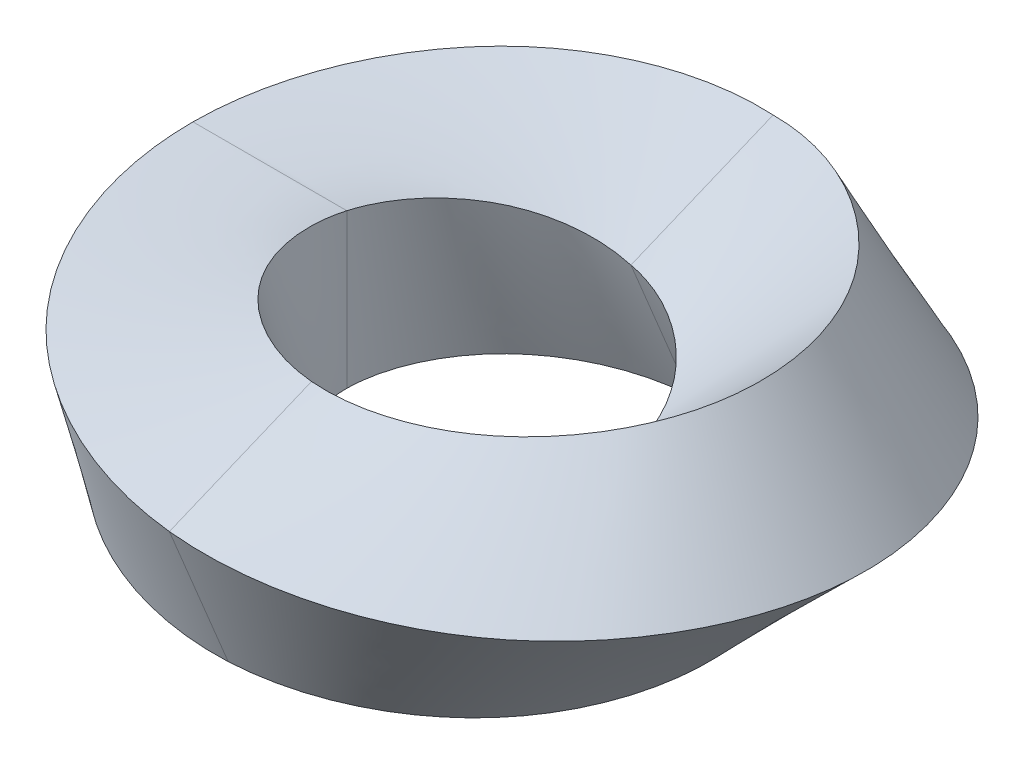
ISO-10303-21;
HEADER;
FILE_DESCRIPTION(('STEP AP214'),'2;1');
FILE_NAME('part.step','',(''),(''),'','','');
FILE_SCHEMA(('AUTOMOTIVE_DESIGN { 1 0 10303 214 1 1 1 1 }'));
ENDSEC;
DATA;
#1=APPLICATION_CONTEXT('core data for automotive mechanical design processes');
#2=APPLICATION_PROTOCOL_DEFINITION('international standard','automotive_design',2000,#1);
#3=PRODUCT_CONTEXT('',#1,'mechanical');
#4=PRODUCT('Part','Part','',(#3));
#5=PRODUCT_RELATED_PRODUCT_CATEGORY('part','',(#4));
#6=PRODUCT_DEFINITION_FORMATION('','',#4);
#7=PRODUCT_DEFINITION_CONTEXT('part definition',#1,'design');
#8=PRODUCT_DEFINITION('design','',#6,#7);
#9=PRODUCT_DEFINITION_SHAPE('','',#8);
#10=(LENGTH_UNIT() NAMED_UNIT(*) SI_UNIT(.MILLI.,.METRE.));
#11=(NAMED_UNIT(*) PLANE_ANGLE_UNIT() SI_UNIT($,.RADIAN.));
#12=(NAMED_UNIT(*) SI_UNIT($,.STERADIAN.) SOLID_ANGLE_UNIT());
#13=UNCERTAINTY_MEASURE_WITH_UNIT(LENGTH_MEASURE(1.E-05),#10,'distance_accuracy_value','');
#14=(GEOMETRIC_REPRESENTATION_CONTEXT(3) GLOBAL_UNCERTAINTY_ASSIGNED_CONTEXT((#13)) GLOBAL_UNIT_ASSIGNED_CONTEXT((#10,
#11,#12)) REPRESENTATION_CONTEXT('',''));
#15=CARTESIAN_POINT('',(0.,0.,0.));
#16=DIRECTION('',(0.,0.,1.));
#17=DIRECTION('',(1.,0.,0.));
#18=AXIS2_PLACEMENT_3D('',#15,#16,#17);
#19=CARTESIAN_POINT('',(7.92893218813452,0.,0.));
#20=CARTESIAN_POINT('',(7.46834548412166,0.462789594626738,-2.07417943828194));
#21=CARTESIAN_POINT('',(6.54718164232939,1.38835917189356,-6.22249523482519));
#22=CARTESIAN_POINT('',(0.0986453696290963,2.72346575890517,-9.32581490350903));
#23=CARTESIAN_POINT('',(-6.94121323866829,3.95355620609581,-7.27731283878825));
#24=CARTESIAN_POINT('',(-11.028981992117,5.03309142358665,-0.260690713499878));
#25=CARTESIAN_POINT('',(-8.94281692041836,5.9140767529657,8.32008630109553));
#26=CARTESIAN_POINT('',(-0.17191092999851,6.58691304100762,13.9532408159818));
#27=CARTESIAN_POINT('',(6.36343142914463,6.81910270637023,11.0718609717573));
#28=CARTESIAN_POINT('',(9.63115010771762,6.93519922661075,9.63115010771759));
#29=CARTESIAN_POINT('',(10.2859547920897,2.35702260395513,0.));
#30=CARTESIAN_POINT('',(9.8187060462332,2.65677665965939,-2.7666983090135));
#31=CARTESIAN_POINT('',(8.88421825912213,3.25627854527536,-8.30003746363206));
#32=CARTESIAN_POINT('',(0.152310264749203,4.00620202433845,-12.7743051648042));
#33=CARTESIAN_POINT('',(-9.49271015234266,4.60840987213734,-9.88337851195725));
#34=CARTESIAN_POINT('',(-14.7469429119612,5.03278347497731,-0.258426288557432));
#35=CARTESIAN_POINT('',(-11.5194606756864,5.26045489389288,10.9170941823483));
#36=CARTESIAN_POINT('',(-0.0176550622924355,5.2998653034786,17.4334344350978));
#37=CARTESIAN_POINT('',(7.72137266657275,5.15548810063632,13.5384588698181));
#38=CARTESIAN_POINT('',(11.5909427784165,5.08329844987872,11.5909427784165));
#39=CARTESIAN_POINT('',(12.6429773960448,4.7140452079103,0.));
#40=CARTESIAN_POINT('',(12.1690666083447,4.85076372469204,-3.45921717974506));
#41=CARTESIAN_POINT('',(11.2212548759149,5.12419791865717,-10.3775796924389));
#42=CARTESIAN_POINT('',(0.205975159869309,5.28893828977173,-16.2227954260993));
#43=CARTESIAN_POINT('',(-12.044207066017,5.26326353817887,-12.4894441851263));
#44=CARTESIAN_POINT('',(-18.4649038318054,5.03247552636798,-0.256161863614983));
#45=CARTESIAN_POINT('',(-14.0961044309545,4.60683303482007,13.5141020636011));
#46=CARTESIAN_POINT('',(0.136600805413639,4.01281756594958,20.9136280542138));
#47=CARTESIAN_POINT('',(9.07931390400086,3.49187349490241,16.005056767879));
#48=CARTESIAN_POINT('',(13.5507354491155,3.23139767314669,13.5507354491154));
#49=CARTESIAN_POINT('',(14.9999999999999,7.07106781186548,0.));
#50=CARTESIAN_POINT('',(14.5194271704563,7.0447507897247,-4.15173605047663));
#51=CARTESIAN_POINT('',(13.5582914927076,6.99211729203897,-12.4551219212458));
#52=CARTESIAN_POINT('',(0.259640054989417,6.57167455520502,-19.6712856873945));
#53=CARTESIAN_POINT('',(-14.5957039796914,5.9181172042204,-15.0955098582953));
#54=CARTESIAN_POINT('',(-22.1828647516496,5.03216757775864,-0.253897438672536));
#55=CARTESIAN_POINT('',(-16.6727481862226,3.95321117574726,16.1111099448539));
#56=CARTESIAN_POINT('',(0.290856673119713,2.72576982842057,24.3938216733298));
#57=CARTESIAN_POINT('',(10.437255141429,1.8282588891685,18.4716546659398));
#58=CARTESIAN_POINT('',(15.5105281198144,1.37949689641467,15.5105281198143));
#59=B_SPLINE_SURFACE_WITH_KNOTS('',3,3,((#19,#20,#21,#22,#23,#24,#25,#26,#27,#28),(#29,#30,#31,
#32,#33,#34,#35,#36,#37,#38),(#39,#40,#41,#42,#43,#44,#45,#46,#47,#48),(#49,#50,#51,#52,#53,#54,
#55,#56,#57,#58)),.UNSPECIFIED.,.F.,.F.,.F.,(4,4),(4,1,1,1,1,1,1,4),(0.,1.),(0.,
0.142862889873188,0.285722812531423,0.428578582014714,0.571431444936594,0.714284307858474,
0.857140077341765,1.),.UNSPECIFIED.);
#60=CARTESIAN_POINT('',(7.92893218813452,0.,0.));
#61=CARTESIAN_POINT('',(7.46834548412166,0.462789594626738,-2.07417943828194));
#62=CARTESIAN_POINT('',(6.54718164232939,1.38835917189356,-6.22249523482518));
#63=CARTESIAN_POINT('',(0.0986453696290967,2.72346575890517,-9.32581490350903));
#64=CARTESIAN_POINT('',(-6.94121323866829,3.9535562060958,-7.27731283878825));
#65=CARTESIAN_POINT('',(-11.028981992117,5.03309142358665,-0.260690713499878));
#66=CARTESIAN_POINT('',(-8.94281692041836,5.91407675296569,8.32008630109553));
#67=CARTESIAN_POINT('',(-0.17191092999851,6.58691304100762,13.9532408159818));
#68=CARTESIAN_POINT('',(6.36343142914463,6.81910270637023,11.0718609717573));
#69=CARTESIAN_POINT('',(9.63115010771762,6.93519922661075,9.63115010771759));
#70=B_SPLINE_CURVE_WITH_KNOTS('',3,(#60,#61,#62,#63,#64,#65,#66,#67,#68,#69),.UNSPECIFIED.,.F.,
.F.,(4,1,1,1,1,1,1,4),(0.,0.142862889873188,0.285722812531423,0.428578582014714,
0.571431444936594,0.714284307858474,0.857140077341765,1.),.UNSPECIFIED.);
#71=CARTESIAN_POINT('',(1.18627211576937E-08,2.70598049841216,-8.46718517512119));
#72=VERTEX_POINT('',#71);
#73=CARTESIAN_POINT('',(-9.99999999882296,4.9999999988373,-9.43028484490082E-09));
#74=VERTEX_POINT('',#73);
#75=EDGE_CURVE('E346',#72,#74,#70,.T.);
#76=CARTESIAN_POINT('',(7.71142770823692E-09,2.70598049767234,-8.46718517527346));
#77=CARTESIAN_POINT('',(2.85825850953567E-09,3.16436192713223,-9.57381583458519));
#78=CARTESIAN_POINT('',(7.76133282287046E-10,3.62274335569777,-10.6804464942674));
#79=CARTESIAN_POINT('',(-6.91868987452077E-10,4.48973979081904,-12.7735610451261));
#80=CARTESIAN_POINT('',(-3.45934511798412E-10,4.89835479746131,-13.7600449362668));
#81=CARTESIAN_POINT('',(3.45934511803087E-10,5.71558481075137,-15.7330127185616));
#82=CARTESIAN_POINT('',(6.91869059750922E-10,6.12419981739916,-16.7194966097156));
#83=CARTESIAN_POINT('',(0.,6.5328148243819,-17.7059805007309));
#84=B_SPLINE_CURVE_WITH_KNOTS('',3,(#76,#77,#78,#79,#80,#81,#82,#83),.UNSPECIFIED.,.F.,.F.,(4,2,
2,4),(0.,3.59342518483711,6.79671259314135,10.0000000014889),.UNSPECIFIED.);
#85=CARTESIAN_POINT('',(4.75690006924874E-09,6.53281482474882,-17.7059804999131));
#86=VERTEX_POINT('',#85);
#87=EDGE_CURVE('E51',#72,#86,#84,.T.);
#88=CARTESIAN_POINT('',(14.9999999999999,7.07106781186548,0.));
#89=CARTESIAN_POINT('',(14.5194271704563,7.0447507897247,-4.15173605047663));
#90=CARTESIAN_POINT('',(13.5582914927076,6.99211729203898,-12.4551219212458));
#91=CARTESIAN_POINT('',(0.259640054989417,6.57167455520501,-19.6712856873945));
#92=CARTESIAN_POINT('',(-14.5957039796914,5.9181172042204,-15.0955098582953));
#93=CARTESIAN_POINT('',(-22.1828647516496,5.03216757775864,-0.253897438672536));
#94=CARTESIAN_POINT('',(-16.6727481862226,3.95321117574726,16.1111099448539));
#95=CARTESIAN_POINT('',(0.290856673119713,2.72576982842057,24.3938216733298));
#96=CARTESIAN_POINT('',(10.437255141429,1.82825888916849,18.4716546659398));
#97=CARTESIAN_POINT('',(15.5105281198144,1.37949689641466,15.5105281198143));
#98=B_SPLINE_CURVE_WITH_KNOTS('',3,(#88,#89,#90,#91,#92,#93,#94,#95,#96,#97),.UNSPECIFIED.,.F.,
.F.,(4,1,1,1,1,1,1,4),(0.,0.142862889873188,0.285722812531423,0.428578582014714,
0.571431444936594,0.714284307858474,0.857140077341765,1.),.UNSPECIFIED.);
#99=CARTESIAN_POINT('',(-20.0000000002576,4.99999999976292,1.84846220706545E-09));
#100=VERTEX_POINT('',#99);
#101=EDGE_CURVE('E112',#100,#86,#98,.F.);
#102=CARTESIAN_POINT('',(-9.9999999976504,4.99999999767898,-9.42155880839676E-09));
#103=CARTESIAN_POINT('',(-10.941176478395,4.99999999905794,-3.8240446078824E-09));
#104=CARTESIAN_POINT('',(-11.8823529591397,4.99999999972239,-1.12689254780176E-09));
#105=CARTESIAN_POINT('',(-13.7647059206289,5.00000000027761,1.12689211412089E-09));
#106=CARTESIAN_POINT('',(-14.7058824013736,5.00000000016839,6.83524715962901E-10));
#107=CARTESIAN_POINT('',(-17.0980392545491,4.9999999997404,-1.05376724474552E-09));
#108=CARTESIAN_POINT('',(-18.54901962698,4.99999999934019,-2.67832503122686E-09));
#109=CARTESIAN_POINT('',(-19.9999999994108,5.,0.));
#110=B_SPLINE_CURVE_WITH_KNOTS('',3,(#102,#103,#104,#105,#106,#107,#108,#109),.UNSPECIFIED.,.F.,
.F.,(4,2,2,4),(0.,2.82352944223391,5.64705888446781,10.0000000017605),.UNSPECIFIED.);
#111=EDGE_CURVE('E126',#74,#100,#110,.T.);
#112=ORIENTED_EDGE('',*,*,#75,.F.);
#113=ORIENTED_EDGE('',*,*,#87,.T.);
#114=ORIENTED_EDGE('',*,*,#101,.F.);
#115=ORIENTED_EDGE('',*,*,#111,.F.);
#116=EDGE_LOOP('',(#112,#113,#114,#115));
#117=FACE_BOUND('',#116,.T.);
#118=ADVANCED_FACE('F31',(#117),#59,.T.);
#119=CARTESIAN_POINT('',(14.9999999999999,7.07106781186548,0.));
#120=CARTESIAN_POINT('',(14.5194271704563,7.0447507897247,-4.15173605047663));
#121=CARTESIAN_POINT('',(13.5582914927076,6.99211729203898,-12.4551219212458));
#122=CARTESIAN_POINT('',(0.259640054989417,6.57167455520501,-19.6712856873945));
#123=CARTESIAN_POINT('',(-14.5957039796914,5.9181172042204,-15.0955098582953));
#124=CARTESIAN_POINT('',(-22.1828647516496,5.03216757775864,-0.253897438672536));
#125=CARTESIAN_POINT('',(-16.6727481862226,3.95321117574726,16.1111099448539));
#126=CARTESIAN_POINT('',(0.290856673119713,2.72576982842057,24.3938216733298));
#127=CARTESIAN_POINT('',(10.437255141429,1.82825888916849,18.4716546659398));
#128=CARTESIAN_POINT('',(15.5105281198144,1.37949689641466,15.5105281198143));
#129=CARTESIAN_POINT('',(17.3570226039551,4.71404520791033,0.));
#130=CARTESIAN_POINT('',(16.5654337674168,4.54223732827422,-4.68855030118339));
#131=CARTESIAN_POINT('',(14.9822725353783,4.1986251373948,-14.0655535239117));
#132=CARTESIAN_POINT('',(0.0637204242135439,3.47329445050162,-21.0864764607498));
#133=CARTESIAN_POINT('',(-15.2359222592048,2.62755940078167,-15.4780338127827));
#134=CARTESIAN_POINT('',(-22.1850660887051,1.67708124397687,-0.0676526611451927));
#135=CARTESIAN_POINT('',(-16.0237244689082,0.664115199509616,15.7486472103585));
#136=CARTESIAN_POINT('',(0.455956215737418,-0.378457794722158,22.8983831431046));
#137=CARTESIAN_POINT('',(9.61929868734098,-1.05419497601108,17.1001801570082));
#138=CARTESIAN_POINT('',(14.2010365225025,-1.39206847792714,14.2010365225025));
#139=CARTESIAN_POINT('',(19.7140452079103,2.35702260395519,0.));
#140=CARTESIAN_POINT('',(18.6114403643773,2.03972386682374,-5.22536455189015));
#141=CARTESIAN_POINT('',(16.406253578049,1.40513298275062,-15.6759851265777));
#142=CARTESIAN_POINT('',(-0.132199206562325,0.374914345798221,-22.5016672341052));
#143=CARTESIAN_POINT('',(-15.8761405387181,-0.662998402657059,-15.8605577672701));
#144=CARTESIAN_POINT('',(-22.1872674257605,-1.67800508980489,0.118592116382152));
#145=CARTESIAN_POINT('',(-15.3747007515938,-2.62498077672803,15.3861844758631));
#146=CARTESIAN_POINT('',(0.621055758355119,-3.48268541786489,21.4029446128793));
#147=CARTESIAN_POINT('',(8.80134223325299,-3.93664884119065,15.7287056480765));
#148=CARTESIAN_POINT('',(12.8915449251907,-4.16363385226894,12.8915449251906));
#149=CARTESIAN_POINT('',(22.0710678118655,0.,0.));
#150=CARTESIAN_POINT('',(20.6574469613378,-0.462789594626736,-5.76217880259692));
#151=CARTESIAN_POINT('',(17.8302346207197,-1.38835917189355,-17.2864167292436));
#152=CARTESIAN_POINT('',(-0.328118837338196,-2.72346575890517,-23.9168580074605));
#153=CARTESIAN_POINT('',(-16.5163588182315,-3.95355620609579,-16.2430817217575));
#154=CARTESIAN_POINT('',(-22.189468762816,-5.03309142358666,0.304836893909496));
#155=CARTESIAN_POINT('',(-14.7256770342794,-5.91407675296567,15.0237217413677));
#156=CARTESIAN_POINT('',(0.786155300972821,-6.58691304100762,19.907506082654));
#157=CARTESIAN_POINT('',(7.983385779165,-6.81910270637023,14.3572311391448));
#158=CARTESIAN_POINT('',(11.5820533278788,-6.93519922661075,11.5820533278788));
#159=B_SPLINE_SURFACE_WITH_KNOTS('',3,3,((#119,#120,#121,#122,#123,#124,#125,#126,#127,#128),
(#129,#130,#131,#132,#133,#134,#135,#136,#137,#138),(#139,#140,#141,#142,#143,#144,#145,#146,
#147,#148),(#149,#150,#151,#152,#153,#154,#155,#156,#157,#158)),.UNSPECIFIED.,.F.,.F.,.F.,(4,4),
(4,1,1,1,1,1,1,4),(0.,1.),(0.,0.142862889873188,0.285722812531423,0.428578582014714,
0.571431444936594,0.714284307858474,0.857140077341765,1.),.UNSPECIFIED.);
#160=CARTESIAN_POINT('',(1.27464720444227E-09,6.53281482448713,-17.7059805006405));
#161=CARTESIAN_POINT('',(5.16814061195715E-10,5.65934433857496,-18.0677838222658));
#162=CARTESIAN_POINT('',(1.52186719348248E-10,4.78587385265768,-18.4295871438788));
#163=CARTESIAN_POINT('',(-1.5218585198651E-10,3.0389328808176,-19.1531937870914));
#164=CARTESIAN_POINT('',(-9.19310814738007E-11,2.16546239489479,-19.514997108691));
#165=CARTESIAN_POINT('',(1.40259624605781E-10,-0.0406655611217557,-20.428805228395));
#166=CARTESIAN_POINT('',(3.54254507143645E-10,-1.37332303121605,-20.980810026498));
#167=CARTESIAN_POINT('',(0.,-2.70598050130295,-21.5328148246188));
#168=B_SPLINE_CURVE_WITH_KNOTS('',3,(#160,#161,#162,#163,#164,#165,#166,#167),.UNSPECIFIED.,.F.,
.F.,(4,2,2,4),(0.,2.83631292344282,5.67262584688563,10.000000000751),.UNSPECIFIED.);
#169=CARTESIAN_POINT('',(-2.80319016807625E-09,-2.7059805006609,-21.5328148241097));
#170=VERTEX_POINT('',#169);
#171=EDGE_CURVE('E44',#86,#170,#168,.T.);
#172=CARTESIAN_POINT('',(22.0710678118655,0.,0.));
#173=CARTESIAN_POINT('',(20.6574469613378,-0.462789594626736,-5.76217880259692));
#174=CARTESIAN_POINT('',(17.8302346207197,-1.38835917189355,-17.2864167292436));
#175=CARTESIAN_POINT('',(-0.328118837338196,-2.72346575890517,-23.9168580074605));
#176=CARTESIAN_POINT('',(-16.5163588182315,-3.95355620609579,-16.2430817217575));
#177=CARTESIAN_POINT('',(-22.189468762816,-5.03309142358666,0.304836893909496));
#178=CARTESIAN_POINT('',(-14.7256770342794,-5.91407675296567,15.0237217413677));
#179=CARTESIAN_POINT('',(0.786155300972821,-6.58691304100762,19.907506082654));
#180=CARTESIAN_POINT('',(7.983385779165,-6.81910270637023,14.3572311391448));
#181=CARTESIAN_POINT('',(11.5820533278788,-6.93519922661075,11.5820533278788));
#182=B_SPLINE_CURVE_WITH_KNOTS('',3,(#172,#173,#174,#175,#176,#177,#178,#179,#180,#181),
.UNSPECIFIED.,.F.,.F.,(4,1,1,1,1,1,1,4),(0.,0.142862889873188,0.285722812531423,
0.428578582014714,0.571431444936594,0.714284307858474,0.857140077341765,1.),.UNSPECIFIED.);
#183=CARTESIAN_POINT('',(-20.0000000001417,-4.99999999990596,-8.55196278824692E-10));
#184=VERTEX_POINT('',#183);
#185=EDGE_CURVE('E95',#170,#184,#182,.T.);
#186=CARTESIAN_POINT('',(-19.9999999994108,5.0000000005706,-4.59948593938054E-09));
#187=CARTESIAN_POINT('',(-19.9999999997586,4.0981295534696,-1.88492752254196E-09));
#188=CARTESIAN_POINT('',(-19.9999999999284,3.19625910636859,-5.59171965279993E-10));
#189=CARTESIAN_POINT('',(-20.0000000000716,1.39251821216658,5.59176302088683E-10));
#190=CARTESIAN_POINT('',(-20.0000000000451,0.49064776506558,3.51769012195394E-10));
#191=CARTESIAN_POINT('',(-19.9999999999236,-1.9408151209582,-5.96603431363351E-10));
#192=CARTESIAN_POINT('',(-19.999999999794,-3.47040755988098,-1.60845892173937E-09));
#193=CARTESIAN_POINT('',(-20.,-4.99999999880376,0.));
#194=B_SPLINE_CURVE_WITH_KNOTS('',3,(#186,#187,#188,#189,#190,#191,#192,#193),.UNSPECIFIED.,.F.,
.F.,(4,2,2,4),(0.,2.70561134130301,5.41122268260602,9.99999999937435),.UNSPECIFIED.);
#195=EDGE_CURVE('E110',#100,#184,#194,.T.);
#196=ORIENTED_EDGE('',*,*,#101,.T.);
#197=ORIENTED_EDGE('',*,*,#171,.T.);
#198=ORIENTED_EDGE('',*,*,#185,.T.);
#199=ORIENTED_EDGE('',*,*,#195,.F.);
#200=EDGE_LOOP('',(#196,#197,#198,#199));
#201=FACE_BOUND('',#200,.T.);
#202=ADVANCED_FACE('F108',(#201),#159,.T.);
#203=CARTESIAN_POINT('',(22.0710678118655,0.,0.));
#204=CARTESIAN_POINT('',(20.6574469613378,-0.462789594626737,-5.76217880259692));
#205=CARTESIAN_POINT('',(17.8302346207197,-1.38835917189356,-17.2864167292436));
#206=CARTESIAN_POINT('',(-0.328118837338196,-2.72346575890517,-23.9168580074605));
#207=CARTESIAN_POINT('',(-16.5163588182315,-3.95355620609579,-16.2430817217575));
#208=CARTESIAN_POINT('',(-22.189468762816,-5.03309142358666,0.304836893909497));
#209=CARTESIAN_POINT('',(-14.7256770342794,-5.91407675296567,15.0237217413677));
#210=CARTESIAN_POINT('',(0.786155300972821,-6.58691304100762,19.9075060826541));
#211=CARTESIAN_POINT('',(7.983385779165,-6.81910270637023,14.3572311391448));
#212=CARTESIAN_POINT('',(11.5820533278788,-6.93519922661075,11.5820533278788));
#213=CARTESIAN_POINT('',(19.7140452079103,-2.35702260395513,0.));
#214=CARTESIAN_POINT('',(18.3070863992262,-2.65677665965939,-5.06965993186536));
#215=CARTESIAN_POINT('',(15.493198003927,-3.25627854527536,-15.2088745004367));
#216=CARTESIAN_POINT('',(-0.381783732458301,-4.00620202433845,-20.4683677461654));
#217=CARTESIAN_POINT('',(-13.9648619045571,-4.60840987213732,-13.6370160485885));
#218=CARTESIAN_POINT('',(-18.4715078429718,-5.03278347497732,0.302572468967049));
#219=CARTESIAN_POINT('',(-12.1490332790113,-5.26045489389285,12.4267138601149));
#220=CARTESIAN_POINT('',(0.631899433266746,-5.2998653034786,16.427312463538));
#221=CARTESIAN_POINT('',(6.62544454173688,-5.15548810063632,11.890633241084));
#222=CARTESIAN_POINT('',(9.62226065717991,-5.08329844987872,9.62226065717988));
#223=CARTESIAN_POINT('',(17.3570226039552,-4.7140452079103,0.));
#224=CARTESIAN_POINT('',(15.9567258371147,-4.85076372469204,-4.3771410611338));
#225=CARTESIAN_POINT('',(13.1561613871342,-5.12419791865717,-13.1313322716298));
#226=CARTESIAN_POINT('',(-0.435448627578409,-5.28893828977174,-17.0198774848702));
#227=CARTESIAN_POINT('',(-11.4133649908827,-5.26326353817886,-11.0309503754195));
#228=CARTESIAN_POINT('',(-14.7535469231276,-5.03247552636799,0.3003080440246));
#229=CARTESIAN_POINT('',(-9.57238952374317,-4.60683303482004,9.82970597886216));
#230=CARTESIAN_POINT('',(0.477643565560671,-4.01281756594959,12.947118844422));
#231=CARTESIAN_POINT('',(5.26750330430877,-3.49187349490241,9.4240353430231));
#232=CARTESIAN_POINT('',(7.66246798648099,-3.2313976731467,7.66246798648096));
#233=CARTESIAN_POINT('',(15.,-7.07106781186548,0.));
#234=CARTESIAN_POINT('',(13.6063652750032,-7.04475078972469,-3.68462219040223));
#235=CARTESIAN_POINT('',(10.8191247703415,-6.99211729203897,-11.053790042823));
#236=CARTESIAN_POINT('',(-0.489113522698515,-6.57167455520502,-13.5713872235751));
#237=CARTESIAN_POINT('',(-8.86186807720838,-5.91811720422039,-8.4248847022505));
#238=CARTESIAN_POINT('',(-11.0355860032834,-5.03216757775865,0.298043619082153));
#239=CARTESIAN_POINT('',(-6.99574576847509,-3.95321117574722,7.23269809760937));
#240=CARTESIAN_POINT('',(0.323387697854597,-2.72576982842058,9.46692522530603));
#241=CARTESIAN_POINT('',(3.90956206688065,-1.8282588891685,6.95743744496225));
#242=CARTESIAN_POINT('',(5.70267531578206,-1.37949689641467,5.70267531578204));
#243=B_SPLINE_SURFACE_WITH_KNOTS('',3,3,((#203,#204,#205,#206,#207,#208,#209,#210,#211,#212),
(#213,#214,#215,#216,#217,#218,#219,#220,#221,#222),(#223,#224,#225,#226,#227,#228,#229,#230,
#231,#232),(#233,#234,#235,#236,#237,#238,#239,#240,#241,#242)),.UNSPECIFIED.,.F.,.F.,.F.,(4,4),
(4,1,1,1,1,1,1,4),(0.,1.),(0.,0.142862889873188,0.285722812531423,0.428578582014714,
0.571431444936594,0.714284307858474,0.857140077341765,1.),.UNSPECIFIED.);
#244=CARTESIAN_POINT('',(-6.9729674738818E-09,-2.70598050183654,-21.5328148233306));
#245=CARTESIAN_POINT('',(-2.8335314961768E-09,-3.06432723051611,-20.66768928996));
#246=CARTESIAN_POINT('',(-8.35685125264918E-10,-3.42267395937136,-19.8025637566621));
#247=CARTESIAN_POINT('',(8.35685125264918E-10,-4.13936741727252,-18.0723126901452));
#248=CARTESIAN_POINT('',(5.09209004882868E-10,-4.49771414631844,-17.2071871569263));
#249=CARTESIAN_POINT('',(-7.94219807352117E-10,-5.41497885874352,-14.9927142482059));
#250=CARTESIAN_POINT('',(-2.03297464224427E-09,-5.97389684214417,-13.6433668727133));
#251=CARTESIAN_POINT('',(0.,-6.53281482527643,-12.2940194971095));
#252=B_SPLINE_CURVE_WITH_KNOTS('',3,(#244,#245,#246,#247,#248,#249,#250,#251),.UNSPECIFIED.,.F.,
.F.,(4,2,2,4),(0.,2.80921538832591,5.61843077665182,10.0000000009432),.UNSPECIFIED.);
#253=CARTESIAN_POINT('',(-9.07411558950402E-09,-6.53281482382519,-12.2940194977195));
#254=VERTEX_POINT('',#253);
#255=EDGE_CURVE('E311',#170,#254,#252,.T.);
#256=CARTESIAN_POINT('',(15.,-7.07106781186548,0.));
#257=CARTESIAN_POINT('',(13.6063652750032,-7.04475078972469,-3.68462219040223));
#258=CARTESIAN_POINT('',(10.8191247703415,-6.99211729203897,-11.053790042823));
#259=CARTESIAN_POINT('',(-0.489113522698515,-6.57167455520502,-13.5713872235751));
#260=CARTESIAN_POINT('',(-8.86186807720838,-5.91811720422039,-8.4248847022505));
#261=CARTESIAN_POINT('',(-11.0355860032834,-5.03216757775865,0.298043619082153));
#262=CARTESIAN_POINT('',(-6.99574576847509,-3.95321117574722,7.23269809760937));
#263=CARTESIAN_POINT('',(0.323387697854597,-2.72576982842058,9.46692522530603));
#264=CARTESIAN_POINT('',(3.90956206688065,-1.8282588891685,6.95743744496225));
#265=CARTESIAN_POINT('',(5.70267531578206,-1.37949689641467,5.70267531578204));
#266=B_SPLINE_CURVE_WITH_KNOTS('',3,(#256,#257,#258,#259,#260,#261,#262,#263,#264,#265),
.UNSPECIFIED.,.F.,.F.,(4,1,1,1,1,1,1,4),(0.,0.142862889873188,0.285722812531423,
0.428578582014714,0.571431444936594,0.714284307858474,0.857140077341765,1.),.UNSPECIFIED.);
#267=CARTESIAN_POINT('',(-10.0000000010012,-5.00000000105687,-8.55055107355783E-09));
#268=VERTEX_POINT('',#267);
#269=EDGE_CURVE('E98',#254,#268,#266,.T.);
#270=CARTESIAN_POINT('',(-20.0000000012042,-4.99999999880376,-9.74966728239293E-09));
#271=CARTESIAN_POINT('',(-18.66616333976,-4.99999999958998,-3.34175126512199E-09));
#272=CARTESIAN_POINT('',(-17.3323266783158,-4.99999999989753,-8.35174434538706E-10));
#273=CARTESIAN_POINT('',(-14.9987416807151,-5.00000000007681,6.2598839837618E-10));
#274=CARTESIAN_POINT('',(-13.9989933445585,-5.0000000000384,3.12994777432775E-10));
#275=CARTESIAN_POINT('',(-11.9994966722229,-4.9999999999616,-3.12992609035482E-10));
#276=CARTESIAN_POINT('',(-10.9997483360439,-4.99999999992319,-6.25986374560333E-10));
#277=CARTESIAN_POINT('',(-9.99999999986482,-5.,0.));
#278=B_SPLINE_CURVE_WITH_KNOTS('',3,(#270,#271,#272,#273,#274,#275,#276,#277),.UNSPECIFIED.,.F.,
.F.,(4,2,2,4),(0.,4.0015099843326,7.00075499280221,10.0000000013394),.UNSPECIFIED.);
#279=EDGE_CURVE('E92',#184,#268,#278,.T.);
#280=ORIENTED_EDGE('',*,*,#185,.F.);
#281=ORIENTED_EDGE('',*,*,#255,.T.);
#282=ORIENTED_EDGE('',*,*,#269,.T.);
#283=ORIENTED_EDGE('',*,*,#279,.F.);
#284=EDGE_LOOP('',(#280,#281,#282,#283));
#285=FACE_BOUND('',#284,.T.);
#286=ADVANCED_FACE('F94',(#285),#243,.T.);
#287=CARTESIAN_POINT('',(15.,-7.07106781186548,0.));
#288=CARTESIAN_POINT('',(13.6063652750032,-7.04475078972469,-3.68462219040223));
#289=CARTESIAN_POINT('',(10.8191247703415,-6.99211729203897,-11.053790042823));
#290=CARTESIAN_POINT('',(-0.489113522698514,-6.57167455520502,-13.5713872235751));
#291=CARTESIAN_POINT('',(-8.86186807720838,-5.91811720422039,-8.4248847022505));
#292=CARTESIAN_POINT('',(-11.0355860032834,-5.03216757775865,0.298043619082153));
#293=CARTESIAN_POINT('',(-6.99574576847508,-3.95321117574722,7.23269809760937));
#294=CARTESIAN_POINT('',(0.323387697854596,-2.72576982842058,9.46692522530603));
#295=CARTESIAN_POINT('',(3.90956206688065,-1.8282588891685,6.95743744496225));
#296=CARTESIAN_POINT('',(5.70267531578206,-1.37949689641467,5.70267531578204));
#297=CARTESIAN_POINT('',(12.6429773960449,-4.71404520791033,0.));
#298=CARTESIAN_POINT('',(11.5603586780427,-4.54223732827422,-3.14780793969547));
#299=CARTESIAN_POINT('',(9.39514372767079,-4.19862513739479,-9.44335844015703));
#300=CARTESIAN_POINT('',(-0.293193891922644,-3.47329445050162,-12.1561964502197));
#301=CARTESIAN_POINT('',(-8.22164979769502,-2.62755940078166,-8.04236074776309));
#302=CARTESIAN_POINT('',(-11.0333846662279,-1.67708124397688,0.11179884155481));
#303=CARTESIAN_POINT('',(-7.6447694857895,-0.664115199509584,7.59516083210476));
#304=CARTESIAN_POINT('',(0.158288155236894,0.378457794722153,10.9623637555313));
#305=CARTESIAN_POINT('',(4.72751852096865,1.05419497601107,8.32891195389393));
#306=CARTESIAN_POINT('',(7.01216691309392,1.39206847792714,7.01216691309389));
#307=CARTESIAN_POINT('',(10.2859547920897,-2.35702260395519,0.));
#308=CARTESIAN_POINT('',(9.51435208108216,-2.03972386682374,-2.61099368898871));
#309=CARTESIAN_POINT('',(7.97116268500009,-1.40513298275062,-7.83292683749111));
#310=CARTESIAN_POINT('',(-0.0972742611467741,-0.374914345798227,-10.7410056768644));
#311=CARTESIAN_POINT('',(-7.58143151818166,0.66299840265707,-7.65983679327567));
#312=CARTESIAN_POINT('',(-11.0311833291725,1.67800508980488,-0.0744459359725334));
#313=CARTESIAN_POINT('',(-8.29379320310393,2.62498077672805,7.95762356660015));
#314=CARTESIAN_POINT('',(-0.00681138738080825,3.48268541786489,12.4578022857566));
#315=CARTESIAN_POINT('',(5.54547497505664,3.93664884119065,9.70038646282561));
#316=CARTESIAN_POINT('',(8.32165851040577,4.16363385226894,8.32165851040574));
#317=CARTESIAN_POINT('',(7.92893218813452,0.,0.));
#318=CARTESIAN_POINT('',(7.46834548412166,0.462789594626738,-2.07417943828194));
#319=CARTESIAN_POINT('',(6.54718164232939,1.38835917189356,-6.22249523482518));
#320=CARTESIAN_POINT('',(0.0986453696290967,2.72346575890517,-9.32581490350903));
#321=CARTESIAN_POINT('',(-6.94121323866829,3.9535562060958,-7.27731283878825));
#322=CARTESIAN_POINT('',(-11.028981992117,5.03309142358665,-0.260690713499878));
#323=CARTESIAN_POINT('',(-8.94281692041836,5.91407675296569,8.32008630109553));
#324=CARTESIAN_POINT('',(-0.17191092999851,6.58691304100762,13.9532408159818));
#325=CARTESIAN_POINT('',(6.36343142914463,6.81910270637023,11.0718609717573));
#326=CARTESIAN_POINT('',(9.63115010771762,6.93519922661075,9.63115010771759));
#327=B_SPLINE_SURFACE_WITH_KNOTS('',3,3,((#287,#288,#289,#290,#291,#292,#293,#294,#295,#296),
(#297,#298,#299,#300,#301,#302,#303,#304,#305,#306),(#307,#308,#309,#310,#311,#312,#313,#314,
#315,#316),(#317,#318,#319,#320,#321,#322,#323,#324,#325,#326)),.UNSPECIFIED.,.F.,.F.,.F.,(4,4),
(4,1,1,1,1,1,1,4),(0.,1.),(0.,0.142862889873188,0.285722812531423,0.428578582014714,
0.571431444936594,0.714284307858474,0.857140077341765,1.),.UNSPECIFIED.);
#328=CARTESIAN_POINT('',(-8.83111346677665E-09,-6.53281482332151,-12.2940194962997));
#329=CARTESIAN_POINT('',(-2.99255405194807E-09,-5.2826808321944,-11.776197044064));
#330=CARTESIAN_POINT('',(-7.38902086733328E-10,-4.03254684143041,-11.2583745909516));
#331=CARTESIAN_POINT('',(5.40660460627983E-10,-1.86768062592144,-10.3616576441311));
#332=CARTESIAN_POINT('',(2.70330338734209E-10,-0.952948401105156,-9.98276315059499));
#333=CARTESIAN_POINT('',(-2.7032990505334E-10,0.876516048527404,-9.22497416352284));
#334=CARTESIAN_POINT('',(-5.40660026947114E-10,1.79124827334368,-8.84607966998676));
#335=CARTESIAN_POINT('',(0.,2.70598049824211,-8.46718517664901));
#336=B_SPLINE_CURVE_WITH_KNOTS('',3,(#328,#329,#330,#331,#332,#333,#334,#335),.UNSPECIFIED.,.F.,
.F.,(4,2,2,4),(0.,4.05940584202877,7.02970291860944,9.99999999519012),.UNSPECIFIED.);
#337=EDGE_CURVE('E133',#254,#72,#336,.T.);
#338=CARTESIAN_POINT('',(-9.99999999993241,-4.99999999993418,2.66958058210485E-10));
#339=CARTESIAN_POINT('',(-9.99999999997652,-3.68905510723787,9.27394837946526E-11));
#340=CARTESIAN_POINT('',(-9.99999999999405,-2.37811021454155,2.35107338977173E-11));
#341=CARTESIAN_POINT('',(-10.0000000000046,-0.055971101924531,-1.81337962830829E-11));
#342=CARTESIAN_POINT('',(-10.0000000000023,0.955223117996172,-9.06668130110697E-12));
#343=CARTESIAN_POINT('',(-9.9999999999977,2.97761155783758,9.06754866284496E-12));
#344=CARTESIAN_POINT('',(-9.99999999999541,3.98880577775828,1.81346636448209E-11));
#345=CARTESIAN_POINT('',(-10.,4.99999999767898,0.));
#346=B_SPLINE_CURVE_WITH_KNOTS('',3,(#338,#339,#340,#341,#342,#343,#344,#345),.UNSPECIFIED.,.F.,
.F.,(4,2,2,4),(0.,3.93283467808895,6.96641733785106,9.99999999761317),.UNSPECIFIED.);
#347=EDGE_CURVE('E174',#268,#74,#346,.T.);
#348=ORIENTED_EDGE('',*,*,#269,.F.);
#349=ORIENTED_EDGE('',*,*,#337,.T.);
#350=ORIENTED_EDGE('',*,*,#75,.T.);
#351=ORIENTED_EDGE('',*,*,#347,.F.);
#352=EDGE_LOOP('',(#348,#349,#350,#351));
#353=FACE_BOUND('',#352,.T.);
#354=ADVANCED_FACE('F199',(#353),#327,.T.);
#355=CARTESIAN_POINT('',(5.70267531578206,1.37949689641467,-5.70267531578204));
#356=CARTESIAN_POINT('',(6.76703592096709,0.920463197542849,-3.84802586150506));
#357=CARTESIAN_POINT('',(8.89575713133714,0.00239579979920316,-0.138726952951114));
#358=CARTESIAN_POINT('',(6.28790734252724,-1.3890704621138,6.25753884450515));
#359=CARTESIAN_POINT('',(0.168936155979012,-2.72301636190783,9.32436444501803));
#360=CARTESIAN_POINT('',(-6.96311179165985,-3.9546424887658,7.24807368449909));
#361=CARTESIAN_POINT('',(-11.0116764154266,-5.02919575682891,0.379095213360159));
#362=CARTESIAN_POINT('',(-8.99014137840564,-5.92857329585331,-8.76446996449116));
#363=CARTESIAN_POINT('',(-2.99673411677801,-6.33139961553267,-11.1174950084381));
#364=CARTESIAN_POINT('',(0.,-6.5328148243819,-12.2940194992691));
#365=CARTESIAN_POINT('',(7.01216691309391,-1.39206847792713,-7.01216691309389));
#366=CARTESIAN_POINT('',(8.52103370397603,-1.71958234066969,-4.78957522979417));
#367=CARTESIAN_POINT('',(11.5387672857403,-2.37461006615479,-0.344391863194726));
#368=CARTESIAN_POINT('',(8.54851339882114,-3.25162080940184,8.38967389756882));
#369=CARTESIAN_POINT('',(0.242341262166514,-4.00724585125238,12.7601442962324));
#370=CARTESIAN_POINT('',(-9.51714201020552,-4.6088920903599,9.8503905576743));
#371=CARTESIAN_POINT('',(-14.7392434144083,-5.02981087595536,0.404535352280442));
#372=CARTESIAN_POINT('',(-11.5258271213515,-5.27186319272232,-11.4685484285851));
#373=CARTESIAN_POINT('',(-3.84196843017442,-5.26209001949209,-14.0719192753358));
#374=CARTESIAN_POINT('',(0.,-5.25720338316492,-15.3736179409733));
#375=CARTESIAN_POINT('',(8.32165851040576,-4.16363385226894,-8.32165851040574));
#376=CARTESIAN_POINT('',(10.275031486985,-4.35962787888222,-5.73112459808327));
#377=CARTESIAN_POINT('',(14.1817774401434,-4.75161593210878,-0.550056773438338));
#378=CARTESIAN_POINT('',(10.809119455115,-5.11417115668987,10.5218089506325));
#379=CARTESIAN_POINT('',(0.315746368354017,-5.29147534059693,16.1959241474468));
#380=CARTESIAN_POINT('',(-12.0711722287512,-5.26314169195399,12.4527074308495));
#381=CARTESIAN_POINT('',(-18.46681041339,-5.03042599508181,0.429975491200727));
#382=CARTESIAN_POINT('',(-14.0615128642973,-4.61515308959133,-14.172626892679));
#383=CARTESIAN_POINT('',(-4.68720274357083,-4.19278042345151,-17.0263435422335));
#384=CARTESIAN_POINT('',(0.,-3.98159194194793,-18.4532163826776));
#385=CARTESIAN_POINT('',(9.63115010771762,-6.93519922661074,-9.63115010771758));
#386=CARTESIAN_POINT('',(12.0290292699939,-6.99967341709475,-6.67267396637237));
#387=CARTESIAN_POINT('',(16.8247875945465,-7.12862179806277,-0.755721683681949));
#388=CARTESIAN_POINT('',(13.0697255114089,-6.97672150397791,12.6539440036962));
#389=CARTESIAN_POINT('',(0.389151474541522,-6.57570482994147,19.6317039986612));
#390=CARTESIAN_POINT('',(-14.6252024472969,-5.91739129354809,15.0550243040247));
#391=CARTESIAN_POINT('',(-22.1943774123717,-5.03104111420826,0.45541563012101));
#392=CARTESIAN_POINT('',(-16.5971986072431,-3.95844298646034,-16.876705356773));
#393=CARTESIAN_POINT('',(-5.53243705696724,-3.12347082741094,-19.9807678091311));
#394=CARTESIAN_POINT('',(0.,-2.70598050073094,-21.5328148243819));
#395=B_SPLINE_SURFACE_WITH_KNOTS('',3,3,((#355,#356,#357,#358,#359,#360,#361,#362,#363,#364),
(#365,#366,#367,#368,#369,#370,#371,#372,#373,#374),(#375,#376,#377,#378,#379,#380,#381,#382,
#383,#384),(#385,#386,#387,#388,#389,#390,#391,#392,#393,#394)),.UNSPECIFIED.,.F.,.F.,.F.,(4,4),
(4,1,1,1,1,1,1,4),(0.,1.),(0.,0.142862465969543,0.285724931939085,0.42858443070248,
0.571439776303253,0.71429221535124,0.857144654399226,1.),.UNSPECIFIED.);
#396=CARTESIAN_POINT('',(9.63115010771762,-6.93519922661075,-9.63115010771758));
#397=CARTESIAN_POINT('',(12.0290292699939,-6.99967341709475,-6.67267396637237));
#398=CARTESIAN_POINT('',(16.8247875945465,-7.12862179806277,-0.755721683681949));
#399=CARTESIAN_POINT('',(13.0697255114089,-6.9767215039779,12.6539440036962));
#400=CARTESIAN_POINT('',(0.389151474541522,-6.57570482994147,19.6317039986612));
#401=CARTESIAN_POINT('',(-14.6252024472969,-5.91739129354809,15.0550243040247));
#402=CARTESIAN_POINT('',(-22.1943774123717,-5.03104111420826,0.45541563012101));
#403=CARTESIAN_POINT('',(-16.5971986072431,-3.95844298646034,-16.876705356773));
#404=CARTESIAN_POINT('',(-5.53243705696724,-3.12347082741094,-19.9807678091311));
#405=CARTESIAN_POINT('',(0.,-2.70598050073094,-21.5328148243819));
#406=B_SPLINE_CURVE_WITH_KNOTS('',3,(#396,#397,#398,#399,#400,#401,#402,#403,#404,#405),
.UNSPECIFIED.,.F.,.F.,(4,1,1,1,1,1,1,4),(0.,0.142862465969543,0.285724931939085,
0.42858443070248,0.571439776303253,0.71429221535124,0.857144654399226,1.),.UNSPECIFIED.);
#407=CARTESIAN_POINT('',(3.7766265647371E-09,-6.53281482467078,17.7059805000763));
#408=VERTEX_POINT('',#407);
#409=EDGE_CURVE('E105',#184,#408,#406,.F.);
#410=CARTESIAN_POINT('',(5.70267531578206,1.37949689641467,-5.70267531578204));
#411=CARTESIAN_POINT('',(6.76703592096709,0.920463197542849,-3.84802586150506));
#412=CARTESIAN_POINT('',(8.89575713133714,0.00239579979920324,-0.138726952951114));
#413=CARTESIAN_POINT('',(6.28790734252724,-1.3890704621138,6.25753884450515));
#414=CARTESIAN_POINT('',(0.168936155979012,-2.72301636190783,9.32436444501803));
#415=CARTESIAN_POINT('',(-6.96311179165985,-3.9546424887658,7.24807368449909));
#416=CARTESIAN_POINT('',(-11.0116764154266,-5.02919575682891,0.379095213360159));
#417=CARTESIAN_POINT('',(-8.99014137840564,-5.92857329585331,-8.76446996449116));
#418=CARTESIAN_POINT('',(-2.99673411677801,-6.33139961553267,-11.1174950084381));
#419=CARTESIAN_POINT('',(0.,-6.5328148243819,-12.2940194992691));
#420=B_SPLINE_CURVE_WITH_KNOTS('',3,(#410,#411,#412,#413,#414,#415,#416,#417,#418,#419),
.UNSPECIFIED.,.F.,.F.,(4,1,1,1,1,1,1,4),(0.,0.142862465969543,0.285724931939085,
0.42858443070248,0.571439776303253,0.71429221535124,0.857144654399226,1.),.UNSPECIFIED.);
#421=CARTESIAN_POINT('',(-2.3251229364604E-09,-2.7059805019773,8.46718517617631));
#422=VERTEX_POINT('',#421);
#423=EDGE_CURVE('E104',#422,#268,#420,.T.);
#424=CARTESIAN_POINT('',(-8.54722473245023E-09,-2.70598050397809,8.46718517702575));
#425=CARTESIAN_POINT('',(-2.89635436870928E-09,-3.22380295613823,9.71731916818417));
#426=CARTESIAN_POINT('',(-7.15149744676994E-10,-3.74162540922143,10.9674531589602));
#427=CARTESIAN_POINT('',(5.23278820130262E-10,-4.63834235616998,13.1323193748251));
#428=CARTESIAN_POINT('',(2.61638651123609E-10,-5.01723684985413,14.047051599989));
#429=CARTESIAN_POINT('',(-2.61641253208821E-10,-5.77502583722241,15.8765160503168));
#430=CARTESIAN_POINT('',(-5.232809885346E-10,-6.15392033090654,16.7912482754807));
#431=CARTESIAN_POINT('',(0.,-6.53281482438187,17.705980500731));
#432=B_SPLINE_CURVE_WITH_KNOTS('',3,(#424,#425,#426,#427,#428,#429,#430,#431),.UNSPECIFIED.,.F.,
.F.,(4,2,2,4),(0.,4.05940584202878,7.02970291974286,9.99999999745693),.UNSPECIFIED.);
#433=EDGE_CURVE('E117',#422,#408,#432,.T.);
#434=ORIENTED_EDGE('',*,*,#409,.F.);
#435=ORIENTED_EDGE('',*,*,#279,.T.);
#436=ORIENTED_EDGE('',*,*,#423,.F.);
#437=ORIENTED_EDGE('',*,*,#433,.T.);
#438=EDGE_LOOP('',(#434,#435,#436,#437));
#439=FACE_BOUND('',#438,.T.);
#440=ADVANCED_FACE('F115',(#439),#395,.T.);
#441=CARTESIAN_POINT('',(11.5820533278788,6.93519922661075,-11.5820533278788));
#442=CARTESIAN_POINT('',(13.4000342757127,6.99967341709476,-7.67407863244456));
#443=CARTESIAN_POINT('',(17.0359961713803,7.12862179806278,0.141870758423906));
#444=CARTESIAN_POINT('',(10.2740088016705,6.9767215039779,11.0144950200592));
#445=CARTESIAN_POINT('',(-0.344606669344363,6.57570482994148,13.5866990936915));
#446=CARTESIAN_POINT('',(-8.89480046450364,5.91739129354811,8.40293153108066));
#447=CARTESIAN_POINT('',(-11.0483578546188,5.03104111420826,-0.225543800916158));
#448=CARTESIAN_POINT('',(-6.91172545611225,3.95844298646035,-7.50074714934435));
#449=CARTESIAN_POINT('',(-2.30392411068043,3.12347082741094,-8.14503698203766));
#450=CARTESIAN_POINT('',(0.,2.70598050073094,-8.4671851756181));
#451=CARTESIAN_POINT('',(9.62226065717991,5.08329844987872,-9.62226065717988));
#452=CARTESIAN_POINT('',(11.1890348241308,4.97327001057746,-6.39872770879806));
#453=CARTESIAN_POINT('',(14.3225831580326,4.75321313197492,0.0483381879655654));
#454=CARTESIAN_POINT('',(8.94530831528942,4.18812418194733,9.42884296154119));
#455=CARTESIAN_POINT('',(-0.173425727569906,3.47613109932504,12.165920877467));
#456=CARTESIAN_POINT('',(-8.25090424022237,2.62671336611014,8.01797891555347));
#457=CARTESIAN_POINT('',(-11.0361307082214,1.67762882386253,-0.023997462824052));
#458=CARTESIAN_POINT('',(-7.60453076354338,0.662770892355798,-7.92198808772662));
#459=CARTESIAN_POINT('',(-2.53486077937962,-0.0281526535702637,-9.13585632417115));
#460=CARTESIAN_POINT('',(0.,-0.373617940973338,-9.74279661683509));
#461=CARTESIAN_POINT('',(7.66246798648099,3.2313976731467,-7.66246798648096));
#462=CARTESIAN_POINT('',(8.97803537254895,2.94686660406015,-5.12337678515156));
#463=CARTESIAN_POINT('',(11.6091701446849,2.37780446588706,-0.0451943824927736));
#464=CARTESIAN_POINT('',(7.61660782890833,1.39952685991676,7.84319090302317));
#465=CARTESIAN_POINT('',(-0.00224478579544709,0.376557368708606,10.7451426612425));
#466=CARTESIAN_POINT('',(-7.60700801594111,-0.663964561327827,7.63302630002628));
#467=CARTESIAN_POINT('',(-11.023903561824,-1.67578346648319,0.177548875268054));
#468=CARTESIAN_POINT('',(-8.29733607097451,-2.63290120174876,-8.34322902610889));
#469=CARTESIAN_POINT('',(-2.76579744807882,-3.17977613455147,-10.1266756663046));
#470=CARTESIAN_POINT('',(0.,-3.45321638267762,-11.0184080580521));
#471=CARTESIAN_POINT('',(5.70267531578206,1.37949689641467,-5.70267531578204));
#472=CARTESIAN_POINT('',(6.76703592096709,0.920463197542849,-3.84802586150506));
#473=CARTESIAN_POINT('',(8.89575713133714,0.00239579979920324,-0.138726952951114));
#474=CARTESIAN_POINT('',(6.28790734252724,-1.3890704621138,6.25753884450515));
#475=CARTESIAN_POINT('',(0.168936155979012,-2.72301636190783,9.32436444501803));
#476=CARTESIAN_POINT('',(-6.96311179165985,-3.9546424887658,7.24807368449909));
#477=CARTESIAN_POINT('',(-11.0116764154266,-5.02919575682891,0.379095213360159));
#478=CARTESIAN_POINT('',(-8.99014137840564,-5.92857329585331,-8.76446996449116));
#479=CARTESIAN_POINT('',(-2.99673411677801,-6.33139961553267,-11.1174950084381));
#480=CARTESIAN_POINT('',(0.,-6.5328148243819,-12.2940194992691));
#481=B_SPLINE_SURFACE_WITH_KNOTS('',3,3,((#441,#442,#443,#444,#445,#446,#447,#448,#449,#450),
(#451,#452,#453,#454,#455,#456,#457,#458,#459,#460),(#461,#462,#463,#464,#465,#466,#467,#468,
#469,#470),(#471,#472,#473,#474,#475,#476,#477,#478,#479,#480)),.UNSPECIFIED.,.F.,.F.,.F.,(4,4),
(4,1,1,1,1,1,1,4),(0.,1.),(0.,0.142862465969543,0.285724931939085,0.42858443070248,
0.571439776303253,0.71429221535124,0.857144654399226,1.),.UNSPECIFIED.);
#482=CARTESIAN_POINT('',(11.5820533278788,6.93519922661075,-11.5820533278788));
#483=CARTESIAN_POINT('',(13.4000342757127,6.99967341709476,-7.67407863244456));
#484=CARTESIAN_POINT('',(17.0359961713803,7.12862179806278,0.141870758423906));
#485=CARTESIAN_POINT('',(10.2740088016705,6.9767215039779,11.0144950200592));
#486=CARTESIAN_POINT('',(-0.344606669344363,6.57570482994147,13.5866990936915));
#487=CARTESIAN_POINT('',(-8.89480046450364,5.91739129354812,8.40293153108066));
#488=CARTESIAN_POINT('',(-11.0483578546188,5.03104111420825,-0.225543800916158));
#489=CARTESIAN_POINT('',(-6.91172545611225,3.95844298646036,-7.50074714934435));
#490=CARTESIAN_POINT('',(-2.30392411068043,3.12347082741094,-8.14503698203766));
#491=CARTESIAN_POINT('',(0.,2.70598050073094,-8.4671851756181));
#492=B_SPLINE_CURVE_WITH_KNOTS('',3,(#482,#483,#484,#485,#486,#487,#488,#489,#490,#491),
.UNSPECIFIED.,.F.,.F.,(4,1,1,1,1,1,1,4),(0.,0.142862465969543,0.285724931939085,
0.42858443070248,0.571439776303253,0.71429221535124,0.857144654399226,1.),.UNSPECIFIED.);
#493=CARTESIAN_POINT('',(4.70437167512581E-09,6.53281482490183,12.2940195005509));
#494=VERTEX_POINT('',#493);
#495=EDGE_CURVE('E135',#494,#74,#492,.T.);
#496=CARTESIAN_POINT('',(0.,6.53281482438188,12.294019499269));
#497=CARTESIAN_POINT('',(0.,5.42618416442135,11.8356380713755));
#498=CARTESIAN_POINT('',(0.,4.31955350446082,11.3772566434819));
#499=CARTESIAN_POINT('',(0.,2.22643895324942,10.5102602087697));
#500=CARTESIAN_POINT('',(0.,1.23995506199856,10.101645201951));
#501=CARTESIAN_POINT('',(0.,-0.733012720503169,9.28441518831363));
#502=CARTESIAN_POINT('',(0.,-1.71949661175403,8.87580018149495));
#503=CARTESIAN_POINT('',(0.,-2.70598050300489,8.46718517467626));
#504=B_SPLINE_CURVE_WITH_KNOTS('',3,(#496,#497,#498,#499,#500,#501,#502,#503),.UNSPECIFIED.,.F.,
.F.,(4,2,2,4),(0.,3.59342518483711,6.79671259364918,10.0000000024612),.UNSPECIFIED.);
#505=EDGE_CURVE('E276',#494,#422,#504,.T.);
#506=ORIENTED_EDGE('',*,*,#423,.T.);
#507=ORIENTED_EDGE('',*,*,#347,.T.);
#508=ORIENTED_EDGE('',*,*,#495,.F.);
#509=ORIENTED_EDGE('',*,*,#505,.T.);
#510=EDGE_LOOP('',(#506,#507,#508,#509));
#511=FACE_BOUND('',#510,.T.);
#512=ADVANCED_FACE('F183',(#511),#481,.T.);
#513=CARTESIAN_POINT('',(9.63115010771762,-6.93519922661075,-9.63115010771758));
#514=CARTESIAN_POINT('',(12.0290292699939,-6.99967341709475,-6.67267396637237));
#515=CARTESIAN_POINT('',(16.8247875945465,-7.12862179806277,-0.755721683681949));
#516=CARTESIAN_POINT('',(13.0697255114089,-6.9767215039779,12.6539440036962));
#517=CARTESIAN_POINT('',(0.389151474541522,-6.57570482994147,19.6317039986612));
#518=CARTESIAN_POINT('',(-14.6252024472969,-5.91739129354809,15.0550243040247));
#519=CARTESIAN_POINT('',(-22.1943774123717,-5.03104111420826,0.45541563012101));
#520=CARTESIAN_POINT('',(-16.5971986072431,-3.95844298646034,-16.876705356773));
#521=CARTESIAN_POINT('',(-5.53243705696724,-3.12347082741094,-19.9807678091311));
#522=CARTESIAN_POINT('',(0.,-2.70598050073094,-21.5328148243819));
#523=CARTESIAN_POINT('',(11.5909427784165,-5.08329844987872,-11.5909427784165));
#524=CARTESIAN_POINT('',(14.2400287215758,-4.97327001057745,-7.94802489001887));
#525=CARTESIAN_POINT('',(19.5382006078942,-4.75321313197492,-0.66218911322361));
#526=CARTESIAN_POINT('',(14.39842599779,-4.18812418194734,14.2395960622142));
#527=CARTESIAN_POINT('',(0.217970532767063,-3.47613109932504,21.0524822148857));
#528=CARTESIAN_POINT('',(-15.2690986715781,-2.62671336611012,15.4399769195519));
#529=CARTESIAN_POINT('',(-22.2066045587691,-1.67762882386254,0.253869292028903));
#530=CARTESIAN_POINT('',(-15.904393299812,-0.662770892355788,-16.4554644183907));
#531=CARTESIAN_POINT('',(-5.30150038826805,0.028152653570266,-18.9899484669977));
#532=CARTESIAN_POINT('',(0.,0.373617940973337,-20.2572033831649));
#533=CARTESIAN_POINT('',(13.5507354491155,-3.2313976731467,-13.5507354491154));
#534=CARTESIAN_POINT('',(16.4510281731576,-2.94686660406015,-9.22337581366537));
#535=CARTESIAN_POINT('',(22.251613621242,-2.37780446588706,-0.568656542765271));
#536=CARTESIAN_POINT('',(15.7271264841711,-1.39952685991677,15.8252481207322));
#537=CARTESIAN_POINT('',(0.0467895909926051,-0.376557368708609,22.4732604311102));
#538=CARTESIAN_POINT('',(-15.9129948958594,0.663964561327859,15.8249295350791));
#539=CARTESIAN_POINT('',(-22.2188317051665,1.67578346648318,0.0523229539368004));
#540=CARTESIAN_POINT('',(-15.2115879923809,2.63290120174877,-16.0342234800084));
#541=CARTESIAN_POINT('',(-5.07056371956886,3.17977613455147,-17.9991291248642));
#542=CARTESIAN_POINT('',(0.,3.45321638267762,-18.9815919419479));
#543=CARTESIAN_POINT('',(15.5105281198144,-1.37949689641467,-15.5105281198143));
#544=CARTESIAN_POINT('',(18.6620276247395,-0.920463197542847,-10.4987267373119));
#545=CARTESIAN_POINT('',(24.9650266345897,-0.00239579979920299,-0.475123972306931));
#546=CARTESIAN_POINT('',(17.0558269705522,1.3890704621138,17.4109001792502));
#547=CARTESIAN_POINT('',(-0.124391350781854,2.72301636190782,23.8940386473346));
#548=CARTESIAN_POINT('',(-16.5568911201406,3.95464248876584,16.2098821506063));
#549=CARTESIAN_POINT('',(-22.2310588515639,5.0291957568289,-0.149223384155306));
#550=CARTESIAN_POINT('',(-14.5187826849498,5.92857329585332,-15.6129825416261));
#551=CARTESIAN_POINT('',(-4.83962705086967,6.33139961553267,-17.0083097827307));
#552=CARTESIAN_POINT('',(0.,6.5328148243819,-17.7059805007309));
#553=B_SPLINE_SURFACE_WITH_KNOTS('',3,3,((#513,#514,#515,#516,#517,#518,#519,#520,#521,#522),
(#523,#524,#525,#526,#527,#528,#529,#530,#531,#532),(#533,#534,#535,#536,#537,#538,#539,#540,
#541,#542),(#543,#544,#545,#546,#547,#548,#549,#550,#551,#552)),.UNSPECIFIED.,.F.,.F.,.F.,(4,4),
(4,1,1,1,1,1,1,4),(0.,1.),(0.,0.142862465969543,0.285724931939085,0.42858443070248,
0.571439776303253,0.71429221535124,0.857144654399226,1.),.UNSPECIFIED.);
#554=CARTESIAN_POINT('',(15.5105281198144,-1.37949689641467,-15.5105281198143));
#555=CARTESIAN_POINT('',(18.6620276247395,-0.920463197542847,-10.4987267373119));
#556=CARTESIAN_POINT('',(24.9650266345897,-0.00239579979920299,-0.475123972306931));
#557=CARTESIAN_POINT('',(17.0558269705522,1.3890704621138,17.4109001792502));
#558=CARTESIAN_POINT('',(-0.124391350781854,2.72301636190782,23.8940386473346));
#559=CARTESIAN_POINT('',(-16.5568911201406,3.95464248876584,16.2098821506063));
#560=CARTESIAN_POINT('',(-22.2310588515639,5.0291957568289,-0.149223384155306));
#561=CARTESIAN_POINT('',(-14.5187826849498,5.92857329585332,-15.6129825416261));
#562=CARTESIAN_POINT('',(-4.83962705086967,6.33139961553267,-17.0083097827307));
#563=CARTESIAN_POINT('',(0.,6.5328148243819,-17.7059805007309));
#564=B_SPLINE_CURVE_WITH_KNOTS('',3,(#554,#555,#556,#557,#558,#559,#560,#561,#562,#563),
.UNSPECIFIED.,.F.,.F.,(4,1,1,1,1,1,1,4),(0.,0.142862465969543,0.285724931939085,
0.42858443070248,0.571439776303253,0.71429221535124,0.857144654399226,1.),.UNSPECIFIED.);
#565=CARTESIAN_POINT('',(4.01284438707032E-09,2.70598050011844,21.5328148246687));
#566=VERTEX_POINT('',#565);
#567=EDGE_CURVE('E123',#566,#100,#564,.T.);
#568=CARTESIAN_POINT('',(0.,-6.53281482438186,17.705980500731));
#569=CARTESIAN_POINT('',(0.,-5.66768929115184,18.0643272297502));
#570=CARTESIAN_POINT('',(0.,-4.80256375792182,18.4226739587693));
#571=CARTESIAN_POINT('',(0.,-3.07231269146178,19.1393674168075));
#572=CARTESIAN_POINT('',(0.,-2.20718715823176,19.4977141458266));
#573=CARTESIAN_POINT('',(0.,0.0072857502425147,20.4149788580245));
#574=CARTESIAN_POINT('',(0.,1.35663312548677,20.9738968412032));
#575=CARTESIAN_POINT('',(0.,2.70598050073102,21.5328148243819));
#576=B_SPLINE_CURVE_WITH_KNOTS('',3,(#568,#569,#570,#571,#572,#573,#574,#575),.UNSPECIFIED.,.F.,
.F.,(4,2,2,4),(0.,2.80921538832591,5.61843077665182,9.99999999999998),.UNSPECIFIED.);
#577=EDGE_CURVE('E290',#408,#566,#576,.T.);
#578=ORIENTED_EDGE('',*,*,#567,.T.);
#579=ORIENTED_EDGE('',*,*,#195,.T.);
#580=ORIENTED_EDGE('',*,*,#409,.T.);
#581=ORIENTED_EDGE('',*,*,#577,.T.);
#582=EDGE_LOOP('',(#578,#579,#580,#581));
#583=FACE_BOUND('',#582,.T.);
#584=ADVANCED_FACE('F122',(#583),#553,.T.);
#585=CARTESIAN_POINT('',(15.5105281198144,-1.37949689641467,-15.5105281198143));
#586=CARTESIAN_POINT('',(18.6620276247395,-0.920463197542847,-10.4987267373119));
#587=CARTESIAN_POINT('',(24.9650266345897,-0.00239579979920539,-0.475123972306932));
#588=CARTESIAN_POINT('',(17.0558269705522,1.3890704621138,17.4109001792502));
#589=CARTESIAN_POINT('',(-0.124391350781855,2.72301636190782,23.8940386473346));
#590=CARTESIAN_POINT('',(-16.5568911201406,3.95464248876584,16.2098821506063));
#591=CARTESIAN_POINT('',(-22.2310588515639,5.0291957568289,-0.149223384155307));
#592=CARTESIAN_POINT('',(-14.5187826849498,5.92857329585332,-15.6129825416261));
#593=CARTESIAN_POINT('',(-4.83962705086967,6.33139961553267,-17.0083097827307));
#594=CARTESIAN_POINT('',(0.,6.5328148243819,-17.7059805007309));
#595=CARTESIAN_POINT('',(14.2010365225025,1.39206847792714,-14.2010365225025));
#596=CARTESIAN_POINT('',(16.9080298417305,1.71958234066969,-9.55717736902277));
#597=CARTESIAN_POINT('',(22.3220164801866,2.37461006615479,-0.269459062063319));
#598=CARTESIAN_POINT('',(14.7952209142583,3.25162080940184,15.2787651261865));
#599=CARTESIAN_POINT('',(-0.197796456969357,4.00724585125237,20.4582587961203));
#600=CARTESIAN_POINT('',(-14.002860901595,4.60889209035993,13.6075652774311));
#601=CARTESIAN_POINT('',(-18.5034918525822,5.02981087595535,-0.174663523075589));
#602=CARTESIAN_POINT('',(-11.9830969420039,5.27186319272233,-12.9089040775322));
#603=CARTESIAN_POINT('',(-3.99439273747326,5.26209001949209,-14.053885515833));
#604=CARTESIAN_POINT('',(0.,5.25720338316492,-14.6263820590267));
#605=CARTESIAN_POINT('',(12.8915449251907,4.16363385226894,-12.8915449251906));
#606=CARTESIAN_POINT('',(15.1540320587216,4.35962787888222,-8.61562800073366));
#607=CARTESIAN_POINT('',(19.6790063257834,4.75161593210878,-0.0637941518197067));
#608=CARTESIAN_POINT('',(12.5346148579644,5.11417115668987,13.1466300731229));
#609=CARTESIAN_POINT('',(-0.27120156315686,5.29147534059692,17.0224789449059));
#610=CARTESIAN_POINT('',(-11.4488306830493,5.26314169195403,11.0052484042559));
#611=CARTESIAN_POINT('',(-14.7759248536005,5.0304259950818,-0.200103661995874));
#612=CARTESIAN_POINT('',(-9.44741119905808,4.61515308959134,-10.2048256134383));
#613=CARTESIAN_POINT('',(-3.14915842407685,4.19278042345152,-11.0994612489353));
#614=CARTESIAN_POINT('',(0.,3.98159194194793,-11.5467836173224));
#615=CARTESIAN_POINT('',(11.5820533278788,6.93519922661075,-11.5820533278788));
#616=CARTESIAN_POINT('',(13.4000342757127,6.99967341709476,-7.67407863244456));
#617=CARTESIAN_POINT('',(17.0359961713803,7.12862179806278,0.141870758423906));
#618=CARTESIAN_POINT('',(10.2740088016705,6.9767215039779,11.0144950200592));
#619=CARTESIAN_POINT('',(-0.344606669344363,6.57570482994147,13.5866990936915));
#620=CARTESIAN_POINT('',(-8.89480046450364,5.91739129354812,8.40293153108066));
#621=CARTESIAN_POINT('',(-11.0483578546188,5.03104111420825,-0.225543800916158));
#622=CARTESIAN_POINT('',(-6.91172545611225,3.95844298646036,-7.50074714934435));
#623=CARTESIAN_POINT('',(-2.30392411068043,3.12347082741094,-8.14503698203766));
#624=CARTESIAN_POINT('',(0.,2.70598050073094,-8.4671851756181));
#625=B_SPLINE_SURFACE_WITH_KNOTS('',3,3,((#585,#586,#587,#588,#589,#590,#591,#592,#593,#594),
(#595,#596,#597,#598,#599,#600,#601,#602,#603,#604),(#605,#606,#607,#608,#609,#610,#611,#612,
#613,#614),(#615,#616,#617,#618,#619,#620,#621,#622,#623,#624)),.UNSPECIFIED.,.F.,.F.,.F.,(4,4),
(4,1,1,1,1,1,1,4),(0.,1.),(0.,0.142862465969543,0.285724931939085,0.42858443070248,
0.571439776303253,0.71429221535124,0.857144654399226,1.),.UNSPECIFIED.);
#626=CARTESIAN_POINT('',(0.,2.705980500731,21.5328148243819));
#627=CARTESIAN_POINT('',(0.,3.06778382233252,20.6593443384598));
#628=CARTESIAN_POINT('',(0.,3.42958714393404,19.7858738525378));
#629=CARTESIAN_POINT('',(0.,4.15319378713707,18.0389328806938));
#630=CARTESIAN_POINT('',(0.,4.51499710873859,17.1654623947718));
#631=CARTESIAN_POINT('',(0.,5.42880522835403,14.9593344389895));
#632=CARTESIAN_POINT('',(0.,5.98081002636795,13.6266769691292));
#633=CARTESIAN_POINT('',(0.,6.53281482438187,12.294019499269));
#634=B_SPLINE_CURVE_WITH_KNOTS('',3,(#626,#627,#628,#629,#630,#631,#632,#633),.UNSPECIFIED.,.F.,
.F.,(4,2,2,4),(0.,2.83631292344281,5.67262584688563,10.),.UNSPECIFIED.);
#635=EDGE_CURVE('E11',#566,#494,#634,.T.);
#636=ORIENTED_EDGE('',*,*,#495,.T.);
#637=ORIENTED_EDGE('',*,*,#111,.T.);
#638=ORIENTED_EDGE('',*,*,#567,.F.);
#639=ORIENTED_EDGE('',*,*,#635,.T.);
#640=EDGE_LOOP('',(#636,#637,#638,#639));
#641=FACE_BOUND('',#640,.T.);
#642=ADVANCED_FACE('F156',(#641),#625,.T.);
#643=CARTESIAN_POINT('',(-20.,-5.,0.));
#644=CARTESIAN_POINT('',(-18.4030869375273,-5.30863450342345,5.05695501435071));
#645=CARTESIAN_POINT('',(-15.2092283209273,-5.92590978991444,15.1709679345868));
#646=CARTESIAN_POINT('',(0.530835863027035,-6.57267251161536,19.6233545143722));
#647=CARTESIAN_POINT('',(13.0870382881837,-6.98033208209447,12.5713902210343));
#648=CARTESIAN_POINT('',(16.6138423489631,-7.11721166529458,-0.417149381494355));
#649=CARTESIAN_POINT('',(10.4576593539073,-6.97723004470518,-10.9028100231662));
#650=CARTESIAN_POINT('',(-0.657052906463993,-6.58508021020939,-13.7581602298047));
#651=CARTESIAN_POINT('',(-5.43820783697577,-6.11460979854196,-9.80520129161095));
#652=CARTESIAN_POINT('',(-7.82875055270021,-5.87937801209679,-7.82875055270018));
#653=CARTESIAN_POINT('',(-16.6666666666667,-5.,0.));
#654=CARTESIAN_POINT('',(-15.2943937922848,-5.0904717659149,4.18768121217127));
#655=CARTESIAN_POINT('',(-12.5498201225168,-5.27141713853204,12.5631288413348));
#656=CARTESIAN_POINT('',(0.430159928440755,-5.2888001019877,16.1842227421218));
#657=CARTESIAN_POINT('',(10.8301334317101,-5.11659642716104,10.4581860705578));
#658=CARTESIAN_POINT('',(13.9832994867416,-4.74459003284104,-0.283857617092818));
#659=CARTESIAN_POINT('',(9.09458867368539,-4.18931595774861,-9.32276739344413));
#660=CARTESIAN_POINT('',(-0.43126151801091,-3.47998676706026,-12.3547019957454));
#661=CARTESIAN_POINT('',(-5.05638841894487,-2.90005527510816,-9.03083006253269));
#662=CARTESIAN_POINT('',(-7.36891825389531,-2.61009374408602,-7.36891825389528));
#663=CARTESIAN_POINT('',(-13.3333333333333,-5.,0.));
#664=CARTESIAN_POINT('',(-12.1857006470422,-4.87230902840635,3.31840740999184));
#665=CARTESIAN_POINT('',(-9.8904119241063,-4.61692448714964,9.95528974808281));
#666=CARTESIAN_POINT('',(0.329483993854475,-4.00492769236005,12.7450909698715));
#667=CARTESIAN_POINT('',(8.57322857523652,-3.2528607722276,8.34498192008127));
#668=CARTESIAN_POINT('',(11.3527566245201,-2.3719684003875,-0.15056585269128));
#669=CARTESIAN_POINT('',(7.73151799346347,-1.40140187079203,-7.74272476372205));
#670=CARTESIAN_POINT('',(-0.205470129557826,-0.374893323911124,-10.9512437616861));
#671=CARTESIAN_POINT('',(-4.67456900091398,0.314499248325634,-8.25645883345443));
#672=CARTESIAN_POINT('',(-6.9090859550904,0.659190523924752,-6.90908595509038));
#673=CARTESIAN_POINT('',(-10.,-5.,0.));
#674=CARTESIAN_POINT('',(-9.0770075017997,-4.6541462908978,2.4491336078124));
#675=CARTESIAN_POINT('',(-7.23100372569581,-3.96243183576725,7.34745065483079));
#676=CARTESIAN_POINT('',(0.228808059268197,-2.7210552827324,9.30595919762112));
#677=CARTESIAN_POINT('',(6.31632371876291,-1.38912511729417,6.23177776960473));
#678=CARTESIAN_POINT('',(8.72221376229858,0.000653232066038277,-0.0172740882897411));
#679=CARTESIAN_POINT('',(6.36844731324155,1.38651221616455,-6.16268213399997));
#680=CARTESIAN_POINT('',(0.020321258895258,2.73020011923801,-9.54778552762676));
#681=CARTESIAN_POINT('',(-4.29274958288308,3.52905377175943,-7.48208760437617));
#682=CARTESIAN_POINT('',(-6.4492536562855,3.92847479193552,-6.44925365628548));
#683=B_SPLINE_SURFACE_WITH_KNOTS('',3,3,((#643,#644,#645,#646,#647,#648,#649,#650,#651,#652),
(#653,#654,#655,#656,#657,#658,#659,#660,#661,#662),(#663,#664,#665,#666,#667,#668,#669,#670,
#671,#672),(#673,#674,#675,#676,#677,#678,#679,#680,#681,#682)),.UNSPECIFIED.,.F.,.F.,.F.,(4,4),
(4,1,1,1,1,1,1,4),(0.,1.),(0.,0.142851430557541,0.28570576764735,0.42856425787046,
0.571425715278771,0.714287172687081,0.857145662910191,1.),.UNSPECIFIED.);
#684=CARTESIAN_POINT('',(-20.,-5.,0.));
#685=CARTESIAN_POINT('',(-18.4030869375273,-5.30863450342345,5.05695501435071));
#686=CARTESIAN_POINT('',(-15.2092283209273,-5.92590978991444,15.1709679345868));
#687=CARTESIAN_POINT('',(0.530835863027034,-6.57267251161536,19.6233545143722));
#688=CARTESIAN_POINT('',(13.0870382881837,-6.98033208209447,12.5713902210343));
#689=CARTESIAN_POINT('',(16.6138423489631,-7.11721166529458,-0.417149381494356));
#690=CARTESIAN_POINT('',(10.4576593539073,-6.97723004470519,-10.9028100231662));
#691=CARTESIAN_POINT('',(-0.657052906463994,-6.58508021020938,-13.7581602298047));
#692=CARTESIAN_POINT('',(-5.43820783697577,-6.11460979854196,-9.80520129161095));
#693=CARTESIAN_POINT('',(-7.82875055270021,-5.87937801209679,-7.82875055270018));
#694=B_SPLINE_CURVE_WITH_KNOTS('',3,(#684,#685,#686,#687,#688,#689,#690,#691,#692,#693),
.UNSPECIFIED.,.F.,.F.,(4,1,1,1,1,1,1,4),(0.,0.142851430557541,0.28570576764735,0.42856425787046,
0.571425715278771,0.714287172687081,0.857145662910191,1.),.UNSPECIFIED.);
#695=EDGE_CURVE('E330',#408,#254,#694,.T.);
#696=CARTESIAN_POINT('',(-10.,-5.,0.));
#697=CARTESIAN_POINT('',(-9.0770075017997,-4.6541462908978,2.4491336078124));
#698=CARTESIAN_POINT('',(-7.23100372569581,-3.96243183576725,7.34745065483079));
#699=CARTESIAN_POINT('',(0.228808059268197,-2.7210552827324,9.30595919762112));
#700=CARTESIAN_POINT('',(6.31632371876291,-1.38912511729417,6.23177776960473));
#701=CARTESIAN_POINT('',(8.72221376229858,0.000653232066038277,-0.0172740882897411));
#702=CARTESIAN_POINT('',(6.36844731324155,1.38651221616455,-6.16268213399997));
#703=CARTESIAN_POINT('',(0.020321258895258,2.73020011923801,-9.54778552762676));
#704=CARTESIAN_POINT('',(-4.29274958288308,3.52905377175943,-7.48208760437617));
#705=CARTESIAN_POINT('',(-6.4492536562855,3.92847479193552,-6.44925365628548));
#706=B_SPLINE_CURVE_WITH_KNOTS('',3,(#696,#697,#698,#699,#700,#701,#702,#703,#704,#705),
.UNSPECIFIED.,.F.,.F.,(4,1,1,1,1,1,1,4),(0.,0.142851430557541,0.28570576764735,0.42856425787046,
0.571425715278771,0.714287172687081,0.857145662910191,1.),.UNSPECIFIED.);
#707=EDGE_CURVE('E317',#422,#72,#706,.T.);
#708=ORIENTED_EDGE('',*,*,#337,.F.);
#709=ORIENTED_EDGE('',*,*,#695,.F.);
#710=ORIENTED_EDGE('',*,*,#433,.F.);
#711=ORIENTED_EDGE('',*,*,#707,.T.);
#712=EDGE_LOOP('',(#708,#709,#710,#711));
#713=FACE_BOUND('',#712,.T.);
#714=ADVANCED_FACE('F160',(#713),#683,.T.);
#715=CARTESIAN_POINT('',(-20.,5.,0.));
#716=CARTESIAN_POINT('',(-19.0487187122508,4.65414629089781,5.38726588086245));
#717=CARTESIAN_POINT('',(-17.14613678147,3.96243183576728,16.1619072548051));
#718=CARTESIAN_POINT('',(0.00148940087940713,2.7210552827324,23.9367131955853));
#719=CARTESIAN_POINT('',(17.1415770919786,1.38912511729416,17.2881738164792));
#720=CARTESIAN_POINT('',(24.49613059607,-0.000653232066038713,-0.0268848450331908));
#721=CARTESIAN_POINT('',(17.3004081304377,-1.38651221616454,-17.1806355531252));
#722=CARTESIAN_POINT('',(-0.633811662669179,-2.73020011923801,-24.3130840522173));
#723=CARTESIAN_POINT('',(-10.0539493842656,-3.52905377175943,-17.9469636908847));
#724=CARTESIAN_POINT('',(-14.763949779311,-3.92847479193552,-14.7639497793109));
#725=CARTESIAN_POINT('',(-20.,1.66666666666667,0.));
#726=CARTESIAN_POINT('',(-18.8335081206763,1.33321935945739,5.27716225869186));
#727=CARTESIAN_POINT('',(-16.5005006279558,0.666317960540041,15.8315941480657));
#728=CARTESIAN_POINT('',(0.177938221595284,-0.376853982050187,22.4989269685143));
#729=CARTESIAN_POINT('',(15.7900641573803,-1.40069394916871,15.7159126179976));
#730=CARTESIAN_POINT('',(21.8687011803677,-2.37283937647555,-0.156973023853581));
#731=CARTESIAN_POINT('',(15.0194918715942,-3.25008482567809,-15.0880270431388));
#732=CARTESIAN_POINT('',(-0.641558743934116,-4.0151601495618,-20.7947761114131));
#733=CARTESIAN_POINT('',(-8.51536886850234,-4.39090578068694,-15.2330428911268));
#734=CARTESIAN_POINT('',(-12.452216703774,-4.57877586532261,-12.452216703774));
#735=CARTESIAN_POINT('',(-20.,-1.66666666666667,0.));
#736=CARTESIAN_POINT('',(-18.6182975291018,-1.98770757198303,5.16705863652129));
#737=CARTESIAN_POINT('',(-15.8548644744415,-2.6297959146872,15.5012810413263));
#738=CARTESIAN_POINT('',(0.354387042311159,-3.47476324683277,21.0611407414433));
#739=CARTESIAN_POINT('',(14.438551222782,-4.19051301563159,14.143651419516));
#740=CARTESIAN_POINT('',(19.2412717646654,-4.74502552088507,-0.287061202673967));
#741=CARTESIAN_POINT('',(12.7385756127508,-5.11365743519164,-12.9954185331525));
#742=CARTESIAN_POINT('',(-0.649305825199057,-5.30012017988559,-17.2764681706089));
#743=CARTESIAN_POINT('',(-6.97678835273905,-5.25275778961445,-12.5191220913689));
#744=CARTESIAN_POINT('',(-10.1404836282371,-5.2290769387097,-10.1404836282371));
#745=CARTESIAN_POINT('',(-20.,-5.,0.));
#746=CARTESIAN_POINT('',(-18.4030869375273,-5.30863450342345,5.05695501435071));
#747=CARTESIAN_POINT('',(-15.2092283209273,-5.92590978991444,15.1709679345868));
#748=CARTESIAN_POINT('',(0.530835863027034,-6.57267251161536,19.6233545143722));
#749=CARTESIAN_POINT('',(13.0870382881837,-6.98033208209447,12.5713902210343));
#750=CARTESIAN_POINT('',(16.6138423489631,-7.11721166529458,-0.417149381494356));
#751=CARTESIAN_POINT('',(10.4576593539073,-6.97723004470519,-10.9028100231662));
#752=CARTESIAN_POINT('',(-0.657052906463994,-6.58508021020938,-13.7581602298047));
#753=CARTESIAN_POINT('',(-5.43820783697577,-6.11460979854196,-9.80520129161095));
#754=CARTESIAN_POINT('',(-7.82875055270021,-5.87937801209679,-7.82875055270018));
#755=B_SPLINE_SURFACE_WITH_KNOTS('',3,3,((#715,#716,#717,#718,#719,#720,#721,#722,#723,#724),
(#725,#726,#727,#728,#729,#730,#731,#732,#733,#734),(#735,#736,#737,#738,#739,#740,#741,#742,
#743,#744),(#745,#746,#747,#748,#749,#750,#751,#752,#753,#754)),.UNSPECIFIED.,.F.,.F.,.F.,(4,4),
(4,1,1,1,1,1,1,4),(0.,1.),(0.,0.142851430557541,0.28570576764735,0.42856425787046,
0.571425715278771,0.714287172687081,0.857145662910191,1.),.UNSPECIFIED.);
#756=CARTESIAN_POINT('',(-20.,5.,0.));
#757=CARTESIAN_POINT('',(-19.0487187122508,4.65414629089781,5.38726588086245));
#758=CARTESIAN_POINT('',(-17.14613678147,3.96243183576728,16.1619072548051));
#759=CARTESIAN_POINT('',(0.00148940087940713,2.7210552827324,23.9367131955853));
#760=CARTESIAN_POINT('',(17.1415770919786,1.38912511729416,17.2881738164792));
#761=CARTESIAN_POINT('',(24.49613059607,-0.000653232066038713,-0.0268848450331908));
#762=CARTESIAN_POINT('',(17.3004081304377,-1.38651221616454,-17.1806355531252));
#763=CARTESIAN_POINT('',(-0.633811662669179,-2.73020011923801,-24.3130840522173));
#764=CARTESIAN_POINT('',(-10.0539493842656,-3.52905377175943,-17.9469636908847));
#765=CARTESIAN_POINT('',(-14.763949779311,-3.92847479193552,-14.7639497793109));
#766=B_SPLINE_CURVE_WITH_KNOTS('',3,(#756,#757,#758,#759,#760,#761,#762,#763,#764,#765),
.UNSPECIFIED.,.F.,.F.,(4,1,1,1,1,1,1,4),(0.,0.142851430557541,0.28570576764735,0.42856425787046,
0.571425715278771,0.714287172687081,0.857145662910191,1.),.UNSPECIFIED.);
#767=EDGE_CURVE('E296',#170,#566,#766,.F.);
#768=ORIENTED_EDGE('',*,*,#255,.F.);
#769=ORIENTED_EDGE('',*,*,#767,.T.);
#770=ORIENTED_EDGE('',*,*,#577,.F.);
#771=ORIENTED_EDGE('',*,*,#695,.T.);
#772=EDGE_LOOP('',(#768,#769,#770,#771));
#773=FACE_BOUND('',#772,.T.);
#774=ADVANCED_FACE('F250',(#773),#755,.T.);
#775=CARTESIAN_POINT('',(-10.,-5.,0.));
#776=CARTESIAN_POINT('',(-9.0770075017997,-4.65414629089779,2.4491336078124));
#777=CARTESIAN_POINT('',(-7.23100372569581,-3.96243183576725,7.34745065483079));
#778=CARTESIAN_POINT('',(0.228808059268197,-2.7210552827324,9.30595919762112));
#779=CARTESIAN_POINT('',(6.31632371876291,-1.38912511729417,6.23177776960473));
#780=CARTESIAN_POINT('',(8.72221376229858,0.000653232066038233,-0.0172740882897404));
#781=CARTESIAN_POINT('',(6.36844731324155,1.38651221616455,-6.16268213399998));
#782=CARTESIAN_POINT('',(0.020321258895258,2.73020011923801,-9.54778552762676));
#783=CARTESIAN_POINT('',(-4.29274958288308,3.52905377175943,-7.48208760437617));
#784=CARTESIAN_POINT('',(-6.4492536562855,3.92847479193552,-6.44925365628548));
#785=CARTESIAN_POINT('',(-10.,-1.66666666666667,0.));
#786=CARTESIAN_POINT('',(-9.29221809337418,-1.33321935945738,2.55923722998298));
#787=CARTESIAN_POINT('',(-7.87663987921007,-0.666317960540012,7.67776376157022));
#788=CARTESIAN_POINT('',(0.0523592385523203,0.376853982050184,10.7437454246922));
#789=CARTESIAN_POINT('',(7.6678366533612,1.40069394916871,7.80403896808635));
#790=CARTESIAN_POINT('',(11.3496431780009,2.37283937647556,0.112814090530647));
#791=CARTESIAN_POINT('',(8.64936357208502,3.25008482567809,-8.25529064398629));
#792=CARTESIAN_POINT('',(0.0280683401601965,4.0151601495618,-13.066093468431));
#793=CARTESIAN_POINT('',(-5.83133009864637,4.39090578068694,-10.1960084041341));
#794=CARTESIAN_POINT('',(-8.76098673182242,4.57877586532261,-8.76098673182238));
#795=CARTESIAN_POINT('',(-10.,1.66666666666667,0.));
#796=CARTESIAN_POINT('',(-9.50742868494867,1.98770757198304,2.66934085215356));
#797=CARTESIAN_POINT('',(-8.52227603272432,2.62979591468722,8.00807686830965));
#798=CARTESIAN_POINT('',(-0.124089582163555,3.47476324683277,12.1815316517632));
#799=CARTESIAN_POINT('',(9.01934958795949,4.19051301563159,9.37630016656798));
#800=CARTESIAN_POINT('',(13.9770725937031,4.74502552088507,0.242902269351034));
#801=CARTESIAN_POINT('',(10.9302798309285,5.11365743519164,-10.3478991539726));
#802=CARTESIAN_POINT('',(0.0358154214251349,5.30012017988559,-16.5844014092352));
#803=CARTESIAN_POINT('',(-7.36991061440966,5.25275778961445,-12.909929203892));
#804=CARTESIAN_POINT('',(-11.0727198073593,5.2290769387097,-11.0727198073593));
#805=CARTESIAN_POINT('',(-10.,5.,0.));
#806=CARTESIAN_POINT('',(-9.72263927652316,5.30863450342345,2.77944447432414));
#807=CARTESIAN_POINT('',(-9.16791218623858,5.92590978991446,8.33838997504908));
#808=CARTESIAN_POINT('',(-0.300538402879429,6.57267251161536,13.6193178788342));
#809=CARTESIAN_POINT('',(10.3708625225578,6.98033208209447,10.9485613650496));
#810=CARTESIAN_POINT('',(16.6045020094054,7.11721166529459,0.372990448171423));
#811=CARTESIAN_POINT('',(13.211196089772,6.97723004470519,-12.4405076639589));
#812=CARTESIAN_POINT('',(0.0435625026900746,6.58508021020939,-20.1027093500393));
#813=CARTESIAN_POINT('',(-8.90849113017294,6.11460979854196,-15.6238500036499));
#814=CARTESIAN_POINT('',(-13.3844528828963,5.87937801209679,-13.3844528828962));
#815=B_SPLINE_SURFACE_WITH_KNOTS('',3,3,((#775,#776,#777,#778,#779,#780,#781,#782,#783,#784),
(#785,#786,#787,#788,#789,#790,#791,#792,#793,#794),(#795,#796,#797,#798,#799,#800,#801,#802,
#803,#804),(#805,#806,#807,#808,#809,#810,#811,#812,#813,#814)),.UNSPECIFIED.,.F.,.F.,.F.,(4,4),
(4,1,1,1,1,1,1,4),(0.,1.),(0.,0.142851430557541,0.28570576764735,0.42856425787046,
0.571425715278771,0.714287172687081,0.857145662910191,1.),.UNSPECIFIED.);
#816=CARTESIAN_POINT('',(-10.,5.,0.));
#817=CARTESIAN_POINT('',(-9.72263927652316,5.30863450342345,2.77944447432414));
#818=CARTESIAN_POINT('',(-9.16791218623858,5.92590978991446,8.33838997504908));
#819=CARTESIAN_POINT('',(-0.300538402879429,6.57267251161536,13.6193178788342));
#820=CARTESIAN_POINT('',(10.3708625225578,6.98033208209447,10.9485613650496));
#821=CARTESIAN_POINT('',(16.6045020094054,7.11721166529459,0.372990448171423));
#822=CARTESIAN_POINT('',(13.211196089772,6.97723004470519,-12.4405076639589));
#823=CARTESIAN_POINT('',(0.0435625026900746,6.58508021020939,-20.1027093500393));
#824=CARTESIAN_POINT('',(-8.90849113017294,6.11460979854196,-15.6238500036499));
#825=CARTESIAN_POINT('',(-13.3844528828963,5.87937801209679,-13.3844528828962));
#826=B_SPLINE_CURVE_WITH_KNOTS('',3,(#816,#817,#818,#819,#820,#821,#822,#823,#824,#825),
.UNSPECIFIED.,.F.,.F.,(4,1,1,1,1,1,1,4),(0.,0.142851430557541,0.28570576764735,0.42856425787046,
0.571425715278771,0.714287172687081,0.857145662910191,1.),.UNSPECIFIED.);
#827=EDGE_CURVE('E271',#494,#86,#826,.T.);
#828=ORIENTED_EDGE('',*,*,#87,.F.);
#829=ORIENTED_EDGE('',*,*,#707,.F.);
#830=ORIENTED_EDGE('',*,*,#505,.F.);
#831=ORIENTED_EDGE('',*,*,#827,.T.);
#832=EDGE_LOOP('',(#828,#829,#830,#831));
#833=FACE_BOUND('',#832,.T.);
#834=ADVANCED_FACE('F245',(#833),#815,.T.);
#835=CARTESIAN_POINT('',(-10.,5.,0.));
#836=CARTESIAN_POINT('',(-9.72263927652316,5.30863450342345,2.77944447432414));
#837=CARTESIAN_POINT('',(-9.16791218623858,5.92590978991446,8.33838997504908));
#838=CARTESIAN_POINT('',(-0.300538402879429,6.57267251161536,13.6193178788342));
#839=CARTESIAN_POINT('',(10.3708625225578,6.98033208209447,10.9485613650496));
#840=CARTESIAN_POINT('',(16.6045020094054,7.11721166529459,0.372990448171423));
#841=CARTESIAN_POINT('',(13.211196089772,6.97723004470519,-12.4405076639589));
#842=CARTESIAN_POINT('',(0.0435625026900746,6.58508021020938,-20.1027093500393));
#843=CARTESIAN_POINT('',(-8.90849113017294,6.11460979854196,-15.6238500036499));
#844=CARTESIAN_POINT('',(-13.3844528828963,5.87937801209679,-13.3844528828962));
#845=CARTESIAN_POINT('',(-13.3333333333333,5.,0.));
#846=CARTESIAN_POINT('',(-12.8313324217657,5.09047176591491,3.64871827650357));
#847=CARTESIAN_POINT('',(-11.8273203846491,5.27141713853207,10.9462290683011));
#848=CARTESIAN_POINT('',(-0.199862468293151,5.2888001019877,17.0584496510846));
#849=CARTESIAN_POINT('',(12.6277673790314,5.11659642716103,13.0617655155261));
#850=CARTESIAN_POINT('',(19.2350448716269,4.74459003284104,0.239698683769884));
#851=CARTESIAN_POINT('',(14.5742667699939,4.18931595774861,-14.020550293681));
#852=CARTESIAN_POINT('',(-0.182228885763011,3.47998676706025,-21.5061675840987));
#853=CARTESIAN_POINT('',(-9.29031054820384,2.90005527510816,-16.3982212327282));
#854=CARTESIAN_POINT('',(-13.8442851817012,2.61009374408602,-13.8442851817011));
#855=CARTESIAN_POINT('',(-16.6666666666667,5.,0.));
#856=CARTESIAN_POINT('',(-15.9400255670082,4.87230902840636,4.51799207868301));
#857=CARTESIAN_POINT('',(-14.4867285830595,4.61692448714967,13.5540681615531));
#858=CARTESIAN_POINT('',(-0.0991865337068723,4.00492769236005,20.4975814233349));
#859=CARTESIAN_POINT('',(14.884672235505,3.2528607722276,15.1749696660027));
#860=CARTESIAN_POINT('',(21.8655877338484,2.3719684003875,0.106406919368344));
#861=CARTESIAN_POINT('',(15.9373374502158,1.40140187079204,-15.6005929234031));
#862=CARTESIAN_POINT('',(-0.408020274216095,0.374893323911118,-22.909625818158));
#863=CARTESIAN_POINT('',(-9.67212996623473,-0.314499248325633,-17.1725924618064));
#864=CARTESIAN_POINT('',(-14.3041174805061,-0.659190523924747,-14.304117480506));
#865=CARTESIAN_POINT('',(-20.,5.,0.));
#866=CARTESIAN_POINT('',(-19.0487187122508,4.65414629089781,5.38726588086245));
#867=CARTESIAN_POINT('',(-17.14613678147,3.96243183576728,16.1619072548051));
#868=CARTESIAN_POINT('',(0.00148940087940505,2.72105528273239,23.9367131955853));
#869=CARTESIAN_POINT('',(17.1415770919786,1.38912511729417,17.2881738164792));
#870=CARTESIAN_POINT('',(24.49613059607,-0.000653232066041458,-0.0268848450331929));
#871=CARTESIAN_POINT('',(17.3004081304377,-1.38651221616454,-17.1806355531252));
#872=CARTESIAN_POINT('',(-0.633811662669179,-2.73020011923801,-24.3130840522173));
#873=CARTESIAN_POINT('',(-10.0539493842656,-3.52905377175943,-17.9469636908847));
#874=CARTESIAN_POINT('',(-14.763949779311,-3.92847479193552,-14.7639497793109));
#875=B_SPLINE_SURFACE_WITH_KNOTS('',3,3,((#835,#836,#837,#838,#839,#840,#841,#842,#843,#844),
(#845,#846,#847,#848,#849,#850,#851,#852,#853,#854),(#855,#856,#857,#858,#859,#860,#861,#862,
#863,#864),(#865,#866,#867,#868,#869,#870,#871,#872,#873,#874)),.UNSPECIFIED.,.F.,.F.,.F.,(4,4),
(4,1,1,1,1,1,1,4),(0.,1.),(0.,0.142851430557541,0.28570576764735,0.42856425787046,
0.571425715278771,0.714287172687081,0.857145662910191,1.),.UNSPECIFIED.);
#876=ORIENTED_EDGE('',*,*,#171,.F.);
#877=ORIENTED_EDGE('',*,*,#827,.F.);
#878=ORIENTED_EDGE('',*,*,#635,.F.);
#879=ORIENTED_EDGE('',*,*,#767,.F.);
#880=EDGE_LOOP('',(#876,#877,#878,#879));
#881=FACE_BOUND('',#880,.T.);
#882=ADVANCED_FACE('F243',(#881),#875,.T.);
#883=CLOSED_SHELL('',(#118,#202,#286,#354,#440,#512,#584,#642,#714,#774,#834,#882));
#884=MANIFOLD_SOLID_BREP('B2',#883);
#885=ADVANCED_BREP_SHAPE_REPRESENTATION('',(#18,#884),#14);
#886=SHAPE_DEFINITION_REPRESENTATION(#9,#885);
ENDSEC;
END-ISO-10303-21;
